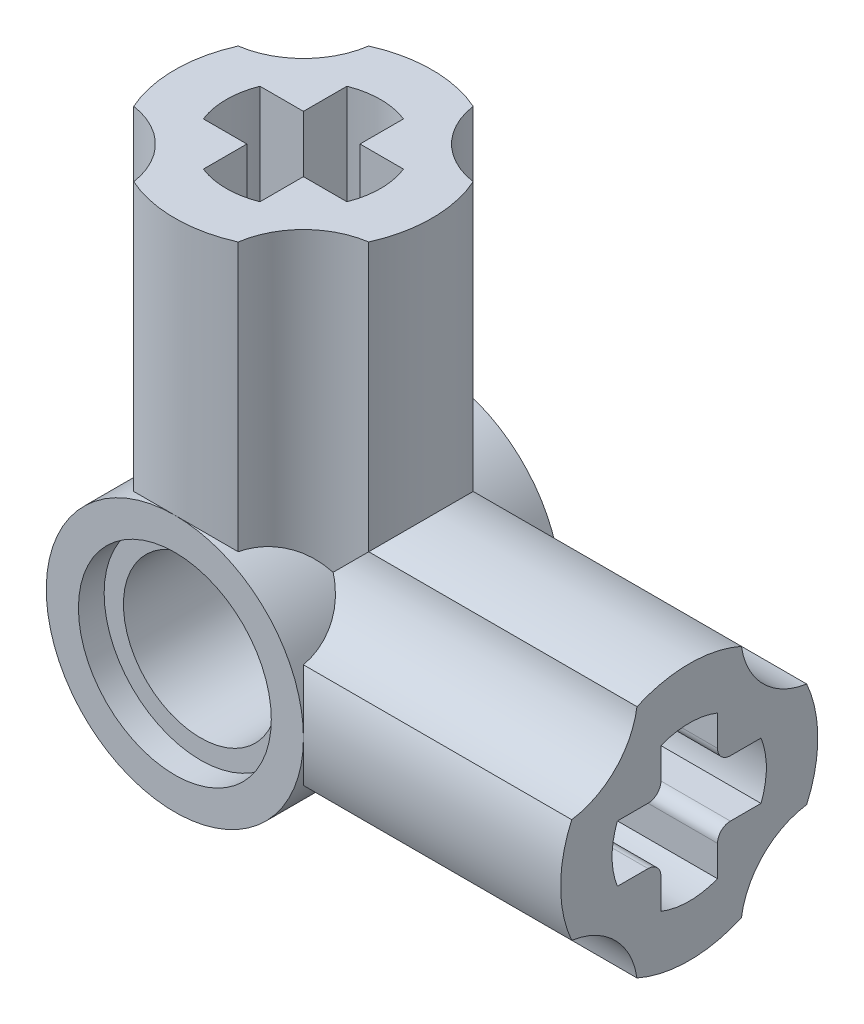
ISO-10303-21;
HEADER;
FILE_DESCRIPTION(('STEP AP214'),'2;1');
FILE_NAME('part.step','',(''),(''),'','','');
FILE_SCHEMA(('AUTOMOTIVE_DESIGN { 1 0 10303 214 1 1 1 1 }'));
ENDSEC;
DATA;
#1=APPLICATION_CONTEXT('core data for automotive mechanical design processes');
#2=APPLICATION_PROTOCOL_DEFINITION('international standard','automotive_design',2000,#1);
#3=PRODUCT_CONTEXT('',#1,'mechanical');
#4=PRODUCT('Part','Part','',(#3));
#5=PRODUCT_RELATED_PRODUCT_CATEGORY('part','',(#4));
#6=PRODUCT_DEFINITION_FORMATION('','',#4);
#7=PRODUCT_DEFINITION_CONTEXT('part definition',#1,'design');
#8=PRODUCT_DEFINITION('design','',#6,#7);
#9=PRODUCT_DEFINITION_SHAPE('','',#8);
#10=(LENGTH_UNIT() NAMED_UNIT(*) SI_UNIT(.MILLI.,.METRE.));
#11=(NAMED_UNIT(*) PLANE_ANGLE_UNIT() SI_UNIT($,.RADIAN.));
#12=(NAMED_UNIT(*) SI_UNIT($,.STERADIAN.) SOLID_ANGLE_UNIT());
#13=UNCERTAINTY_MEASURE_WITH_UNIT(LENGTH_MEASURE(1.E-05),#10,'distance_accuracy_value','');
#14=(GEOMETRIC_REPRESENTATION_CONTEXT(3) GLOBAL_UNCERTAINTY_ASSIGNED_CONTEXT((#13)) GLOBAL_UNIT_ASSIGNED_CONTEXT((#10,
#11,#12)) REPRESENTATION_CONTEXT('',''));
#15=CARTESIAN_POINT('',(0.,0.,0.));
#16=DIRECTION('',(0.,0.,1.));
#17=DIRECTION('',(1.,0.,0.));
#18=AXIS2_PLACEMENT_3D('',#15,#16,#17);
#19=CARTESIAN_POINT('',(-12.,0.,-4.));
#20=DIRECTION('',(0.,0.,1.));
#21=DIRECTION('',(1.,0.,0.));
#22=AXIS2_PLACEMENT_3D('',#19,#20,#21);
#23=CYLINDRICAL_SURFACE('',#22,4.);
#24=CARTESIAN_POINT('',(-10.375086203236,3.65508620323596,-3.65508620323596));
#25=CARTESIAN_POINT('',(-10.3663499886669,3.6511923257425,-3.59486576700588));
#26=CARTESIAN_POINT('',(-10.3553154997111,3.64625909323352,-3.53504696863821));
#27=CARTESIAN_POINT('',(-10.3288074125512,3.63419138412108,-3.41662458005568));
#28=CARTESIAN_POINT('',(-10.3133336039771,3.6270568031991,-3.35802104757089));
#29=CARTESIAN_POINT('',(-10.2781165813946,3.61046958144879,-3.24248433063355));
#30=CARTESIAN_POINT('',(-10.2583761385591,3.60101844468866,-3.18555008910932));
#31=CARTESIAN_POINT('',(-10.2148697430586,3.57965042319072,-3.07373991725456));
#32=CARTESIAN_POINT('',(-10.1911039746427,3.5677336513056,-3.0188638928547));
#33=CARTESIAN_POINT('',(-10.114107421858,3.52799627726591,-2.85777764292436));
#34=CARTESIAN_POINT('',(-10.0551913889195,3.49619476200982,-2.75515449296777));
#35=CARTESIAN_POINT('',(-9.9255116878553,3.42083149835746,-2.56268164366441));
#36=CARTESIAN_POINT('',(-9.85475604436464,3.37727770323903,-2.47282336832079));
#37=CARTESIAN_POINT('',(-9.7062336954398,3.27818541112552,-2.30858168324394));
#38=CARTESIAN_POINT('',(-9.62854800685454,3.22277694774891,-2.2340463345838));
#39=CARTESIAN_POINT('',(-9.46997240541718,3.09984101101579,-2.10000614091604));
#40=CARTESIAN_POINT('',(-9.38908270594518,3.03231434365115,-2.0405002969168));
#41=CARTESIAN_POINT('',(-9.22442455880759,2.88255864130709,-1.93338471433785));
#42=CARTESIAN_POINT('',(-9.14070232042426,2.79978283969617,-1.88647591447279));
#43=CARTESIAN_POINT('',(-8.97797282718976,2.62331757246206,-1.80641185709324));
#44=CARTESIAN_POINT('',(-8.89897728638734,2.52960256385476,-1.77328964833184));
#45=CARTESIAN_POINT('',(-8.77678381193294,2.36999962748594,-1.72863096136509));
#46=CARTESIAN_POINT('',(-8.73124104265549,2.30680175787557,-1.71365358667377));
#47=CARTESIAN_POINT('',(-8.64357970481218,2.17728118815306,-1.68744785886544));
#48=CARTESIAN_POINT('',(-8.60146262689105,2.11095714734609,-1.67622113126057));
#49=CARTESIAN_POINT('',(-8.52124740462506,1.97595890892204,-1.65692530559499));
#50=CARTESIAN_POINT('',(-8.48312990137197,1.90729838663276,-1.64884043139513));
#51=CARTESIAN_POINT('',(-8.41094214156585,1.76772376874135,-1.63516177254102));
#52=CARTESIAN_POINT('',(-8.37686797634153,1.69681193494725,-1.62956556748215));
#53=CARTESIAN_POINT('',(-8.34491379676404,1.62491379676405,-1.62491379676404));
#54=B_SPLINE_CURVE_WITH_KNOTS('',3,(#24,#25,#26,#27,#28,#29,#30,#31,#32,#33,#34,#35,#36,#37,#38,
#39,#40,#41,#42,#43,#44,#45,#46,#47,#48,#49,#50,#51,#52,#53),.UNSPECIFIED.,.F.,.F.,(4,2,2,2,2,2,
2,2,2,2,2,2,2,2,4),(0.,0.182870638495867,0.365749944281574,0.548510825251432,0.731263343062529,
1.09690984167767,1.4623095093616,1.82388969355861,2.18544583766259,2.56420913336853,
2.9438752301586,3.18164590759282,3.41951950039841,3.65618273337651,3.89261528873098),.UNSPECIFIED.);
#55=CARTESIAN_POINT('',(-10.3750862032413,3.65508620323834,-3.65508620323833));
#56=VERTEX_POINT('',#55);
#57=CARTESIAN_POINT('',(-9.17157287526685,2.82842712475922,-1.90538380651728));
#58=VERTEX_POINT('',#57);
#59=EDGE_CURVE('P0_E1296',#56,#58,#54,.T.);
#60=ORIENTED_EDGE('',*,*,#59,.T.);
#61=CARTESIAN_POINT('',(-10.3750862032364,3.65508620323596,-1.62491379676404));
#62=CARTESIAN_POINT('',(-10.2823139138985,3.61387188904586,-1.63092923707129));
#63=CARTESIAN_POINT('',(-10.1911709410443,3.56909577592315,-1.6384992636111));
#64=CARTESIAN_POINT('',(-10.0126857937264,3.47287100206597,-1.65807936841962));
#65=CARTESIAN_POINT('',(-9.92535378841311,3.42140579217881,-1.67010060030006));
#66=CARTESIAN_POINT('',(-9.75492013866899,3.31209012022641,-1.7000001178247));
#67=CARTESIAN_POINT('',(-9.67185200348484,3.25419788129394,-1.7179184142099));
#68=CARTESIAN_POINT('',(-9.51161777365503,3.13337103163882,-1.76101246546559));
#69=CARTESIAN_POINT('',(-9.43444436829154,3.07044287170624,-1.78617903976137));
#70=CARTESIAN_POINT('',(-9.26343126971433,2.92025141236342,-1.85455544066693));
#71=CARTESIAN_POINT('',(-9.17204364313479,2.83158792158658,-1.90095472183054));
#72=CARTESIAN_POINT('',(-9.00335038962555,2.65238561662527,-2.01130610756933));
#73=CARTESIAN_POINT('',(-8.92598770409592,2.56185614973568,-2.07518430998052));
#74=CARTESIAN_POINT('',(-8.82101407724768,2.42844107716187,-2.1851770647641));
#75=CARTESIAN_POINT('',(-8.78775386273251,2.38418821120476,-2.22439555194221));
#76=CARTESIAN_POINT('',(-8.72509637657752,2.29735939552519,-2.30748194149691));
#77=CARTESIAN_POINT('',(-8.6956974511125,2.25478273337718,-2.35134783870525));
#78=CARTESIAN_POINT('',(-8.64070585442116,2.17200832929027,-2.44362830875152));
#79=CARTESIAN_POINT('',(-8.61511868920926,2.13181407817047,-2.49204929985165));
#80=CARTESIAN_POINT('',(-8.5677048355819,2.05460502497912,-2.59305777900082));
#81=CARTESIAN_POINT('',(-8.54587776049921,2.01758989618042,-2.64564483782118));
#82=CARTESIAN_POINT('',(-8.48962965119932,1.91902233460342,-2.79865941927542));
#83=CARTESIAN_POINT('',(-8.45926306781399,1.86177889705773,-2.90344215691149));
#84=CARTESIAN_POINT('',(-8.40905565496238,1.763013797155,-3.12233368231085));
#85=CARTESIAN_POINT('',(-8.38920111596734,1.72147167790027,-3.23643009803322));
#86=CARTESIAN_POINT('',(-8.3675178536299,1.67490117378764,-3.40287021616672));
#87=CARTESIAN_POINT('',(-8.36190160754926,1.6626424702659,-3.45281321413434));
#88=CARTESIAN_POINT('',(-8.35224853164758,1.64135387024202,-3.55343145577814));
#89=CARTESIAN_POINT('',(-8.34820866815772,1.6323177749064,-3.6041050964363));
#90=CARTESIAN_POINT('',(-8.34491379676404,1.62491379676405,-3.6550862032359));
#91=B_SPLINE_CURVE_WITH_KNOTS('',3,(#61,#62,#63,#64,#65,#66,#67,#68,#69,#70,#71,#72,#73,#74,#75,
#76,#77,#78,#79,#80,#81,#82,#83,#84,#85,#86,#87,#88,#89,#90),.UNSPECIFIED.,.F.,.F.,(4,2,2,2,2,2,
2,2,2,2,2,2,2,2,4),(0.,0.305068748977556,0.61090715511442,0.918864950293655,1.22643439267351,
1.63131432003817,2.0345081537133,2.23779057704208,2.44098564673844,2.64447143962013,
2.84793629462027,3.21562348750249,3.58282996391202,3.73791688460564,3.89270385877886),.UNSPECIFIED.);
#92=CARTESIAN_POINT('',(-8.34491379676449,1.62491379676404,-3.65508620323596));
#93=VERTEX_POINT('',#92);
#94=EDGE_CURVE('P0_E806',#58,#93,#91,.T.);
#95=ORIENTED_EDGE('',*,*,#94,.T.);
#96=CARTESIAN_POINT('',(-12.0000000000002,0.,0.));
#97=DIRECTION('',(0.707106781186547,0.,0.707106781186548));
#98=DIRECTION('',(0.707106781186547,0.,-0.707106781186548));
#99=AXIS2_PLACEMENT_3D('',#96,#97,#98);
#100=ELLIPSE('',#99,5.65685424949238,4.);
#101=CARTESIAN_POINT('',(-8.,0.,-4.));
#102=VERTEX_POINT('',#101);
#103=EDGE_CURVE('P0_E830',#93,#102,#100,.F.);
#104=ORIENTED_EDGE('',*,*,#103,.T.);
#105=CARTESIAN_POINT('',(-12.,0.,-4.));
#106=DIRECTION('',(0.,0.,1.));
#107=DIRECTION('',(1.,0.,0.));
#108=AXIS2_PLACEMENT_3D('',#105,#106,#107);
#109=CIRCLE('',#108,4.);
#110=CARTESIAN_POINT('',(-12.,4.,-4.));
#111=VERTEX_POINT('',#110);
#112=EDGE_CURVE('P0_E860',#102,#111,#109,.T.);
#113=ORIENTED_EDGE('',*,*,#112,.T.);
#114=CARTESIAN_POINT('',(-12.,0.,0.));
#115=DIRECTION('',(0.,0.707106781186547,0.707106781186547));
#116=DIRECTION('',(0.,0.707106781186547,-0.707106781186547));
#117=AXIS2_PLACEMENT_3D('',#114,#115,#116);
#118=ELLIPSE('',#117,5.65685424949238,4.);
#119=EDGE_CURVE('P0_E69',#111,#56,#118,.F.);
#120=ORIENTED_EDGE('',*,*,#119,.T.);
#121=EDGE_LOOP('',(#60,#95,#104,#113,#120));
#122=FACE_BOUND('',#121,.T.);
#123=ADVANCED_FACE('P0_F41',(#122),#23,.T.);
#124=CARTESIAN_POINT('',(-13.6249137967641,3.65508620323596,-3.65508620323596));
#125=VERTEX_POINT('',#124);
#126=EDGE_CURVE('P0_E624',#125,#111,#118,.F.);
#127=ORIENTED_EDGE('',*,*,#126,.T.);
#128=EDGE_CURVE('P0_E859',#111,#102,#109,.T.);
#129=ORIENTED_EDGE('',*,*,#128,.T.);
#130=CARTESIAN_POINT('',(-8.34491379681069,-1.62491379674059,-3.65508620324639));
#131=VERTEX_POINT('',#130);
#132=EDGE_CURVE('P0_E853',#102,#131,#100,.F.);
#133=ORIENTED_EDGE('',*,*,#132,.T.);
#134=CARTESIAN_POINT('',(-8.3449137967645,-1.62491379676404,-3.65508620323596));
#135=CARTESIAN_POINT('',(-8.34880767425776,-1.63365001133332,-3.59486576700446));
#136=CARTESIAN_POINT('',(-8.35374090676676,-1.64468450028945,-3.5350469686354));
#137=CARTESIAN_POINT('',(-8.3658086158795,-1.67119258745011,-3.41662458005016));
#138=CARTESIAN_POINT('',(-8.37294319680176,-1.68666639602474,-3.35802104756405));
#139=CARTESIAN_POINT('',(-8.38953041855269,-1.72188341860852,-3.2424843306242));
#140=CARTESIAN_POINT('',(-8.39898155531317,-1.74162386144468,-3.18555008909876));
#141=CARTESIAN_POINT('',(-8.42034957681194,-1.78513025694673,-3.07373991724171));
#142=CARTESIAN_POINT('',(-8.43226634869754,-1.80889602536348,-3.01886389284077));
#143=CARTESIAN_POINT('',(-8.47200372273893,-1.88589257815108,-2.85777764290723));
#144=CARTESIAN_POINT('',(-8.50380523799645,-1.94480861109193,-2.75515449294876));
#145=CARTESIAN_POINT('',(-8.57916850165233,-2.07448831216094,-2.56268164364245));
#146=CARTESIAN_POINT('',(-8.62272229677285,-2.1452439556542,-2.47282336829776));
#147=CARTESIAN_POINT('',(-8.72181458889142,-2.29376630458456,-2.3085816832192));
#148=CARTESIAN_POINT('',(-8.77722305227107,-2.37145199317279,-2.23404633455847));
#149=CARTESIAN_POINT('',(-8.90015898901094,-2.53002759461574,-2.10000614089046));
#150=CARTESIAN_POINT('',(-8.96768565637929,-2.61091729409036,-2.04050029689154));
#151=CARTESIAN_POINT('',(-9.11744135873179,-2.77557544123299,-1.93338471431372));
#152=CARTESIAN_POINT('',(-9.2002171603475,-2.85929767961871,-1.88647591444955));
#153=CARTESIAN_POINT('',(-9.37668242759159,-3.02202717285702,-1.80641185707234));
#154=CARTESIAN_POINT('',(-9.4703974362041,-3.10102271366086,-1.77328964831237));
#155=CARTESIAN_POINT('',(-9.63000037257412,-3.22321618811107,-1.72863096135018));
#156=CARTESIAN_POINT('',(-9.69319824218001,-3.26875895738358,-1.71365358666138));
#157=CARTESIAN_POINT('',(-9.82271881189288,-3.35642029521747,-1.6874478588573));
#158=CARTESIAN_POINT('',(-9.88904285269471,-3.39853737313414,-1.67622113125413));
#159=CARTESIAN_POINT('',(-10.024041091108,-3.47875259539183,-1.65692530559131));
#160=CARTESIAN_POINT('',(-10.0927016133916,-3.51687009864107,-1.6488404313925));
#161=CARTESIAN_POINT('',(-10.2322762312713,-3.58905785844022,-1.63516177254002));
#162=CARTESIAN_POINT('',(-10.3031880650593,-3.62313202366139,-1.62956556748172));
#163=CARTESIAN_POINT('',(-10.3750862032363,-3.65508620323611,-1.62491379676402));
#164=B_SPLINE_CURVE_WITH_KNOTS('',3,(#134,#135,#136,#137,#138,#139,#140,#141,#142,#143,#144,
#145,#146,#147,#148,#149,#150,#151,#152,#153,#154,#155,#156,#157,#158,#159,#160,#161,#162,#163),
.UNSPECIFIED.,.F.,.F.,(4,2,2,2,2,2,2,2,2,2,2,2,2,2,4),(0.,0.182870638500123,0.365749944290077,
0.548510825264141,0.731263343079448,1.09690984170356,1.46230950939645,1.82388969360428,
2.18544583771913,2.56420913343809,2.94387523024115,3.18164590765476,3.41951950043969,
3.65618273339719,3.89261528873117),.UNSPECIFIED.);
#165=CARTESIAN_POINT('',(-10.3750862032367,-3.65508620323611,-1.62491379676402));
#166=VERTEX_POINT('',#165);
#167=EDGE_CURVE('P0_E847',#131,#166,#164,.T.);
#168=ORIENTED_EDGE('',*,*,#167,.T.);
#169=CARTESIAN_POINT('',(-12.0000000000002,0.,0.));
#170=DIRECTION('',(0.707106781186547,0.,0.707106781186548));
#171=DIRECTION('',(0.707106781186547,0.,-0.707106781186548));
#172=AXIS2_PLACEMENT_3D('',#169,#170,#171);
#173=ELLIPSE('',#172,5.65685424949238,4.);
#174=CARTESIAN_POINT('',(-12.0000000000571,-4.,0.));
#175=VERTEX_POINT('',#174);
#176=EDGE_CURVE('P0_E855',#166,#175,#173,.F.);
#177=ORIENTED_EDGE('',*,*,#176,.T.);
#178=CARTESIAN_POINT('',(-12.0000000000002,0.,0.));
#179=DIRECTION('',(0.707106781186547,0.,-0.707106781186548));
#180=DIRECTION('',(0.707106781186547,0.,0.707106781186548));
#181=AXIS2_PLACEMENT_3D('',#178,#179,#180);
#182=ELLIPSE('',#181,5.65685424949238,4.);
#183=CARTESIAN_POINT('',(-10.3750862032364,-3.65508620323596,1.62491379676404));
#184=VERTEX_POINT('',#183);
#185=EDGE_CURVE('P0_E854',#175,#184,#182,.F.);
#186=ORIENTED_EDGE('',*,*,#185,.T.);
#187=CARTESIAN_POINT('',(-10.3750862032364,-3.65508620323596,1.62491379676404));
#188=CARTESIAN_POINT('',(-10.2823139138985,-3.61387188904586,1.63092923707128));
#189=CARTESIAN_POINT('',(-10.1911709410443,-3.56909577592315,1.6384992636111));
#190=CARTESIAN_POINT('',(-10.0126857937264,-3.47287100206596,1.65807936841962));
#191=CARTESIAN_POINT('',(-9.9253537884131,-3.42140579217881,1.67010060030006));
#192=CARTESIAN_POINT('',(-9.75492013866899,-3.3120901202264,1.7000001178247));
#193=CARTESIAN_POINT('',(-9.67185200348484,-3.25419788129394,1.71791841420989));
#194=CARTESIAN_POINT('',(-9.51161777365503,-3.13337103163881,1.76101246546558));
#195=CARTESIAN_POINT('',(-9.43444436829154,-3.07044287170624,1.78617903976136));
#196=CARTESIAN_POINT('',(-9.26343126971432,-2.92025141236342,1.85455544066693));
#197=CARTESIAN_POINT('',(-9.17204364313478,-2.83158792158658,1.90095472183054));
#198=CARTESIAN_POINT('',(-9.00335038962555,-2.65238561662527,2.01130610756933));
#199=CARTESIAN_POINT('',(-8.92598770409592,-2.56185614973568,2.07518430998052));
#200=CARTESIAN_POINT('',(-8.82101407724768,-2.42844107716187,2.1851770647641));
#201=CARTESIAN_POINT('',(-8.7877538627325,-2.38418821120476,2.22439555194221));
#202=CARTESIAN_POINT('',(-8.72509637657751,-2.29735939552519,2.30748194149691));
#203=CARTESIAN_POINT('',(-8.69569745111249,-2.25478273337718,2.35134783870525));
#204=CARTESIAN_POINT('',(-8.64070585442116,-2.17200832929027,2.44362830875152));
#205=CARTESIAN_POINT('',(-8.61511868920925,-2.13181407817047,2.49204929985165));
#206=CARTESIAN_POINT('',(-8.5677048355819,-2.05460502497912,2.59305777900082));
#207=CARTESIAN_POINT('',(-8.54587776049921,-2.01758989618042,2.64564483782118));
#208=CARTESIAN_POINT('',(-8.48962965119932,-1.91902233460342,2.79865941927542));
#209=CARTESIAN_POINT('',(-8.45926306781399,-1.86177889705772,2.90344215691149));
#210=CARTESIAN_POINT('',(-8.40905565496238,-1.763013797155,3.12233368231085));
#211=CARTESIAN_POINT('',(-8.38920111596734,-1.72147167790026,3.23643009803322));
#212=CARTESIAN_POINT('',(-8.3675178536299,-1.67490117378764,3.40287021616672));
#213=CARTESIAN_POINT('',(-8.36190160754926,-1.66264247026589,3.45281321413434));
#214=CARTESIAN_POINT('',(-8.35224853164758,-1.64135387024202,3.55343145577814));
#215=CARTESIAN_POINT('',(-8.34820866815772,-1.6323177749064,3.6041050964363));
#216=CARTESIAN_POINT('',(-8.34491379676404,-1.62491379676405,3.65508620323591));
#217=B_SPLINE_CURVE_WITH_KNOTS('',3,(#187,#188,#189,#190,#191,#192,#193,#194,#195,#196,#197,
#198,#199,#200,#201,#202,#203,#204,#205,#206,#207,#208,#209,#210,#211,#212,#213,#214,#215,#216),
.UNSPECIFIED.,.F.,.F.,(4,2,2,2,2,2,2,2,2,2,2,2,2,2,4),(0.,0.305068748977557,0.610907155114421,
0.918864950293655,1.22643439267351,1.63131432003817,2.03450815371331,2.23779057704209,
2.44098564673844,2.64447143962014,2.84793629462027,3.21562348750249,3.58282996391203,
3.73791688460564,3.89270385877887),.UNSPECIFIED.);
#218=CARTESIAN_POINT('',(-8.34491379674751,-1.62491379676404,3.65508620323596));
#219=VERTEX_POINT('',#218);
#220=EDGE_CURVE('P0_E794',#184,#219,#217,.T.);
#221=ORIENTED_EDGE('',*,*,#220,.T.);
#222=CARTESIAN_POINT('',(-12.0000000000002,0.,0.));
#223=DIRECTION('',(0.707106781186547,0.,-0.707106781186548));
#224=DIRECTION('',(0.707106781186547,0.,0.707106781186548));
#225=AXIS2_PLACEMENT_3D('',#222,#223,#224);
#226=ELLIPSE('',#225,5.65685424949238,4.);
#227=CARTESIAN_POINT('',(-8.,0.,4.));
#228=VERTEX_POINT('',#227);
#229=EDGE_CURVE('P0_E795',#219,#228,#226,.F.);
#230=ORIENTED_EDGE('',*,*,#229,.T.);
#231=CARTESIAN_POINT('',(-12.,0.,4.));
#232=DIRECTION('',(0.,0.,1.));
#233=DIRECTION('',(1.,0.,0.));
#234=AXIS2_PLACEMENT_3D('',#231,#232,#233);
#235=CIRCLE('',#234,4.);
#236=CARTESIAN_POINT('',(-12.,4.,4.));
#237=VERTEX_POINT('',#236);
#238=EDGE_CURVE('P0_E798',#237,#228,#235,.T.);
#239=ORIENTED_EDGE('',*,*,#238,.F.);
#240=CARTESIAN_POINT('',(-12.,0.,0.));
#241=DIRECTION('',(0.,0.707106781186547,-0.707106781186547));
#242=DIRECTION('',(0.,0.707106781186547,0.707106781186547));
#243=AXIS2_PLACEMENT_3D('',#240,#241,#242);
#244=ELLIPSE('',#243,5.65685424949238,4.);
#245=CARTESIAN_POINT('',(-13.6249137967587,3.65508620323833,3.65508620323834));
#246=VERTEX_POINT('',#245);
#247=EDGE_CURVE('P0_E383',#237,#246,#244,.F.);
#248=ORIENTED_EDGE('',*,*,#247,.T.);
#249=CARTESIAN_POINT('',(-13.624913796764,3.65508620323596,3.65508620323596));
#250=CARTESIAN_POINT('',(-13.6336500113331,3.65119232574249,3.59486576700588));
#251=CARTESIAN_POINT('',(-13.6446845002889,3.64625909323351,3.53504696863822));
#252=CARTESIAN_POINT('',(-13.6711925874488,3.63419138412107,3.41662458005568));
#253=CARTESIAN_POINT('',(-13.6866663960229,3.62705680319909,3.35802104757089));
#254=CARTESIAN_POINT('',(-13.7218834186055,3.61046958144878,3.24248433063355));
#255=CARTESIAN_POINT('',(-13.7416238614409,3.60101844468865,3.18555008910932));
#256=CARTESIAN_POINT('',(-13.7851302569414,3.57965042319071,3.07373991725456));
#257=CARTESIAN_POINT('',(-13.8088960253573,3.56773365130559,3.0188638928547));
#258=CARTESIAN_POINT('',(-13.885892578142,3.5279962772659,2.85777764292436));
#259=CARTESIAN_POINT('',(-13.9448086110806,3.49619476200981,2.75515449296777));
#260=CARTESIAN_POINT('',(-14.0744883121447,3.42083149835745,2.56268164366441));
#261=CARTESIAN_POINT('',(-14.1452439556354,3.37727770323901,2.47282336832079));
#262=CARTESIAN_POINT('',(-14.2937663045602,3.2781854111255,2.30858168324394));
#263=CARTESIAN_POINT('',(-14.3714519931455,3.22277694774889,2.2340463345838));
#264=CARTESIAN_POINT('',(-14.5300275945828,3.09984101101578,2.10000614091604));
#265=CARTESIAN_POINT('',(-14.6109172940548,3.03231434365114,2.0405002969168));
#266=CARTESIAN_POINT('',(-14.7755754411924,2.88255864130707,1.93338471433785));
#267=CARTESIAN_POINT('',(-14.8592976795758,2.79978283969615,1.88647591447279));
#268=CARTESIAN_POINT('',(-15.0220271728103,2.62331757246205,1.80641185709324));
#269=CARTESIAN_POINT('',(-15.1010227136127,2.52960256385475,1.77328964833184));
#270=CARTESIAN_POINT('',(-15.2232161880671,2.36999962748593,1.72863096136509));
#271=CARTESIAN_POINT('',(-15.2687589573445,2.30680175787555,1.71365358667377));
#272=CARTESIAN_POINT('',(-15.3564202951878,2.17728118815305,1.68744785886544));
#273=CARTESIAN_POINT('',(-15.398537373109,2.11095714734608,1.67622113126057));
#274=CARTESIAN_POINT('',(-15.4787525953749,1.97595890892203,1.65692530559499));
#275=CARTESIAN_POINT('',(-15.516870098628,1.90729838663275,1.64884043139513));
#276=CARTESIAN_POINT('',(-15.5890578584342,1.76772376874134,1.63516177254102));
#277=CARTESIAN_POINT('',(-15.6231320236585,1.69681193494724,1.62956556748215));
#278=CARTESIAN_POINT('',(-15.655086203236,1.62491379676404,1.62491379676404));
#279=B_SPLINE_CURVE_WITH_KNOTS('',3,(#249,#250,#251,#252,#253,#254,#255,#256,#257,#258,#259,
#260,#261,#262,#263,#264,#265,#266,#267,#268,#269,#270,#271,#272,#273,#274,#275,#276,#277,#278),
.UNSPECIFIED.,.F.,.F.,(4,2,2,2,2,2,2,2,2,2,2,2,2,2,4),(0.,0.182870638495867,0.365749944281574,
0.548510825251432,0.731263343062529,1.09690984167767,1.4623095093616,1.82388969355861,
2.18544583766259,2.56420913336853,2.9438752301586,3.18164590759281,3.4195195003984,
3.6561827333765,3.89261528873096),.UNSPECIFIED.);
#280=CARTESIAN_POINT('',(-15.655086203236,1.62491379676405,1.62491379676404));
#281=VERTEX_POINT('',#280);
#282=EDGE_CURVE('P0_E566',#246,#281,#279,.T.);
#283=ORIENTED_EDGE('',*,*,#282,.T.);
#284=CARTESIAN_POINT('',(-12.,0.,0.));
#285=DIRECTION('',(0.,0.707106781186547,-0.707106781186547));
#286=DIRECTION('',(0.,0.707106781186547,0.707106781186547));
#287=AXIS2_PLACEMENT_3D('',#284,#285,#286);
#288=ELLIPSE('',#287,5.65685424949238,4.);
#289=CARTESIAN_POINT('',(-16.,0.,0.));
#290=VERTEX_POINT('',#289);
#291=EDGE_CURVE('P0_E1244',#281,#290,#288,.F.);
#292=ORIENTED_EDGE('',*,*,#291,.T.);
#293=CARTESIAN_POINT('',(-12.,0.,0.));
#294=DIRECTION('',(0.,0.707106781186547,0.707106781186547));
#295=DIRECTION('',(0.,0.707106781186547,-0.707106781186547));
#296=AXIS2_PLACEMENT_3D('',#293,#294,#295);
#297=ELLIPSE('',#296,5.65685424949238,4.);
#298=CARTESIAN_POINT('',(-15.6550862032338,1.62491379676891,-1.62491379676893));
#299=VERTEX_POINT('',#298);
#300=EDGE_CURVE('P0_E623',#290,#299,#297,.F.);
#301=ORIENTED_EDGE('',*,*,#300,.T.);
#302=CARTESIAN_POINT('',(-15.655086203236,1.62491379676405,-1.62491379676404));
#303=CARTESIAN_POINT('',(-15.6138718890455,1.71768608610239,-1.63092923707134));
#304=CARTESIAN_POINT('',(-15.5690957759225,1.80882905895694,-1.63849926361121));
#305=CARTESIAN_POINT('',(-15.4728710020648,1.9873142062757,-1.65807936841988));
#306=CARTESIAN_POINT('',(-15.4214057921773,2.0746462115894,-1.67010060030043));
#307=CARTESIAN_POINT('',(-15.3120901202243,2.2450798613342,-1.70000011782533));
#308=CARTESIAN_POINT('',(-15.2541978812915,2.32814799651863,-1.7179184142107));
#309=CARTESIAN_POINT('',(-15.1333710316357,2.48838222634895,-1.7610124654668));
#310=CARTESIAN_POINT('',(-15.0704428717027,2.56555563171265,-1.78617903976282));
#311=CARTESIAN_POINT('',(-14.9202514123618,2.73656873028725,-1.85455544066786));
#312=CARTESIAN_POINT('',(-14.8315879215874,2.82795635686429,-1.90095472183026));
#313=CARTESIAN_POINT('',(-14.6523856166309,2.99664961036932,-2.01130610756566));
#314=CARTESIAN_POINT('',(-14.5618561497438,3.07401229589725,-2.07518430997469));
#315=CARTESIAN_POINT('',(-14.4284410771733,3.17898592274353,-2.18517706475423));
#316=CARTESIAN_POINT('',(-14.3841882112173,3.21224613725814,-2.22439555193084));
#317=CARTESIAN_POINT('',(-14.2973593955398,3.27490362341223,-2.3074819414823));
#318=CARTESIAN_POINT('',(-14.2547827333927,3.3043025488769,-2.35134783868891));
#319=CARTESIAN_POINT('',(-14.1720083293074,3.35929414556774,-2.44362830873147));
#320=CARTESIAN_POINT('',(-14.1318140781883,3.3848813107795,-2.49204929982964));
#321=CARTESIAN_POINT('',(-14.0546050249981,3.43229516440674,-2.59305777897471));
#322=CARTESIAN_POINT('',(-14.0175898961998,3.45412223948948,-2.64564483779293));
#323=CARTESIAN_POINT('',(-13.9190223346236,3.51037034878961,-2.79865941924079));
#324=CARTESIAN_POINT('',(-13.861778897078,3.54073693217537,-2.90344215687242));
#325=CARTESIAN_POINT('',(-13.7630137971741,3.59094434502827,-3.1223336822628));
#326=CARTESIAN_POINT('',(-13.7214716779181,3.61079888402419,-3.23643009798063));
#327=CARTESIAN_POINT('',(-13.6749011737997,3.63248214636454,-3.40287021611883));
#328=CARTESIAN_POINT('',(-13.6626424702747,3.63809839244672,-3.45281321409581));
#329=CARTESIAN_POINT('',(-13.6413538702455,3.64775146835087,-3.55343145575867));
#330=CARTESIAN_POINT('',(-13.6323177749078,3.65179133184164,-3.60410509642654));
#331=CARTESIAN_POINT('',(-13.6249137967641,3.65508620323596,-3.65508620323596));
#332=B_SPLINE_CURVE_WITH_KNOTS('',3,(#302,#303,#304,#305,#306,#307,#308,#309,#310,#311,#312,
#313,#314,#315,#316,#317,#318,#319,#320,#321,#322,#323,#324,#325,#326,#327,#328,#329,#330,#331),
.UNSPECIFIED.,.F.,.F.,(4,2,2,2,2,2,2,2,2,2,2,2,2,2,4),(0.,0.305068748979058,0.610907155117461,
0.918864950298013,1.22643439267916,1.63131432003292,2.03450815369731,2.23779057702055,
2.44098564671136,2.64447143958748,2.84793629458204,3.21562348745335,3.58282996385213,
3.7379168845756,3.89270385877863),.UNSPECIFIED.);
#333=EDGE_CURVE('P0_E616',#299,#125,#332,.T.);
#334=ORIENTED_EDGE('',*,*,#333,.T.);
#335=EDGE_LOOP('',(#127,#129,#133,#168,#177,#186,#221,#230,#239,#248,#283,#292,#301,#334));
#336=FACE_BOUND('',#335,.T.);
#337=ADVANCED_FACE('P0_F526',(#336),#23,.T.);
#338=CARTESIAN_POINT('',(-8.34491379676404,1.62491379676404,1.62491379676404));
#339=CARTESIAN_POINT('',(-8.38612811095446,1.71768608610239,1.63092923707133));
#340=CARTESIAN_POINT('',(-8.43090422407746,1.80882905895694,1.6384992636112));
#341=CARTESIAN_POINT('',(-8.52712899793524,1.9873142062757,1.65807936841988));
#342=CARTESIAN_POINT('',(-8.5785942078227,2.0746462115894,1.67010060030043));
#343=CARTESIAN_POINT('',(-8.68790987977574,2.2450798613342,1.70000011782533));
#344=CARTESIAN_POINT('',(-8.74580211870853,2.32814799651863,1.71791841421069));
#345=CARTESIAN_POINT('',(-8.86662896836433,2.48838222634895,1.76101246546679));
#346=CARTESIAN_POINT('',(-8.92955712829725,2.56555563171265,1.78617903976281));
#347=CARTESIAN_POINT('',(-9.07974858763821,2.73656873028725,1.85455544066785));
#348=CARTESIAN_POINT('',(-9.16841207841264,2.82795635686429,1.90095472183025));
#349=CARTESIAN_POINT('',(-9.34761438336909,2.99664961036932,2.01130610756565));
#350=CARTESIAN_POINT('',(-9.43814385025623,3.07401229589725,2.07518430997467));
#351=CARTESIAN_POINT('',(-9.57155892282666,3.17898592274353,2.18517706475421));
#352=CARTESIAN_POINT('',(-9.61581178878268,3.21224613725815,2.22439555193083));
#353=CARTESIAN_POINT('',(-9.70264060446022,3.27490362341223,2.30748194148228));
#354=CARTESIAN_POINT('',(-9.74521726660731,3.30430254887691,2.35134783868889));
#355=CARTESIAN_POINT('',(-9.8279916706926,3.35929414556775,2.44362830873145));
#356=CARTESIAN_POINT('',(-9.8681859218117,3.38488131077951,2.49204929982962));
#357=CARTESIAN_POINT('',(-9.94539497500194,3.43229516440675,2.59305777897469));
#358=CARTESIAN_POINT('',(-9.98241010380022,3.45412223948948,2.64564483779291));
#359=CARTESIAN_POINT('',(-10.0809776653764,3.51037034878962,2.79865941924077));
#360=CARTESIAN_POINT('',(-10.138221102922,3.54073693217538,2.9034421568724));
#361=CARTESIAN_POINT('',(-10.236986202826,3.59094434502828,3.12233368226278));
#362=CARTESIAN_POINT('',(-10.2785283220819,3.61079888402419,3.23643009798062));
#363=CARTESIAN_POINT('',(-10.3250988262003,3.63248214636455,3.40287021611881));
#364=CARTESIAN_POINT('',(-10.3373575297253,3.63809839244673,3.45281321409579));
#365=CARTESIAN_POINT('',(-10.3586461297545,3.64775146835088,3.55343145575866));
#366=CARTESIAN_POINT('',(-10.3676822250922,3.65179133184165,3.60410509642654));
#367=CARTESIAN_POINT('',(-10.375086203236,3.65508620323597,3.65508620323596));
#368=B_SPLINE_CURVE_WITH_KNOTS('',3,(#338,#339,#340,#341,#342,#343,#344,#345,#346,#347,#348,
#349,#350,#351,#352,#353,#354,#355,#356,#357,#358,#359,#360,#361,#362,#363,#364,#365,#366,#367),
.UNSPECIFIED.,.F.,.F.,(4,2,2,2,2,2,2,2,2,2,2,2,2,2,4),(0.,0.305068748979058,0.610907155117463,
0.918864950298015,1.22643439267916,1.63131432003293,2.03450815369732,2.23779057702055,
2.44098564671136,2.64447143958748,2.84793629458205,3.21562348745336,3.58282996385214,
3.73791688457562,3.89270385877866),.UNSPECIFIED.);
#369=CARTESIAN_POINT('',(-9.17157287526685,2.82842712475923,1.90538380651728));
#370=VERTEX_POINT('',#369);
#371=CARTESIAN_POINT('',(-10.3750862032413,3.65508620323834,3.65508620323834));
#372=VERTEX_POINT('',#371);
#373=EDGE_CURVE('P0_E546',#370,#372,#368,.T.);
#374=ORIENTED_EDGE('',*,*,#373,.T.);
#375=EDGE_CURVE('P0_E549',#372,#237,#244,.F.);
#376=ORIENTED_EDGE('',*,*,#375,.T.);
#377=EDGE_CURVE('P0_E856',#228,#237,#235,.T.);
#378=ORIENTED_EDGE('',*,*,#377,.F.);
#379=CARTESIAN_POINT('',(-8.34491379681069,1.62491379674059,3.65508620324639));
#380=VERTEX_POINT('',#379);
#381=EDGE_CURVE('P0_E799',#228,#380,#226,.F.);
#382=ORIENTED_EDGE('',*,*,#381,.T.);
#383=CARTESIAN_POINT('',(-8.34491379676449,1.62491379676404,3.65508620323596));
#384=CARTESIAN_POINT('',(-8.34880767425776,1.63365001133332,3.59486576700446));
#385=CARTESIAN_POINT('',(-8.35374090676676,1.64468450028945,3.5350469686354));
#386=CARTESIAN_POINT('',(-8.3658086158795,1.67119258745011,3.41662458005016));
#387=CARTESIAN_POINT('',(-8.37294319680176,1.68666639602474,3.35802104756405));
#388=CARTESIAN_POINT('',(-8.38953041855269,1.72188341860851,3.2424843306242));
#389=CARTESIAN_POINT('',(-8.39898155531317,1.74162386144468,3.18555008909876));
#390=CARTESIAN_POINT('',(-8.42034957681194,1.78513025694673,3.07373991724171));
#391=CARTESIAN_POINT('',(-8.43226634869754,1.80889602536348,3.01886389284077));
#392=CARTESIAN_POINT('',(-8.47200372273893,1.88589257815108,2.85777764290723));
#393=CARTESIAN_POINT('',(-8.50380523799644,1.94480861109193,2.75515449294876));
#394=CARTESIAN_POINT('',(-8.57916850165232,2.07448831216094,2.56268164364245));
#395=CARTESIAN_POINT('',(-8.62272229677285,2.1452439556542,2.47282336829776));
#396=CARTESIAN_POINT('',(-8.72181458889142,2.29376630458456,2.3085816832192));
#397=CARTESIAN_POINT('',(-8.77722305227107,2.37145199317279,2.23404633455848));
#398=CARTESIAN_POINT('',(-8.90015898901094,2.53002759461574,2.10000614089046));
#399=CARTESIAN_POINT('',(-8.96768565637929,2.61091729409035,2.04050029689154));
#400=CARTESIAN_POINT('',(-9.11744135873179,2.77557544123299,1.93338471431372));
#401=CARTESIAN_POINT('',(-9.20021716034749,2.8592976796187,1.88647591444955));
#402=CARTESIAN_POINT('',(-9.37668242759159,3.02202717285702,1.80641185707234));
#403=CARTESIAN_POINT('',(-9.47039743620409,3.10102271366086,1.77328964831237));
#404=CARTESIAN_POINT('',(-9.63000037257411,3.22321618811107,1.72863096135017));
#405=CARTESIAN_POINT('',(-9.69319824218,3.26875895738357,1.71365358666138));
#406=CARTESIAN_POINT('',(-9.82271881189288,3.35642029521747,1.6874478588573));
#407=CARTESIAN_POINT('',(-9.88904285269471,3.39853737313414,1.67622113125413));
#408=CARTESIAN_POINT('',(-10.024041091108,3.47875259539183,1.65692530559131));
#409=CARTESIAN_POINT('',(-10.0927016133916,3.51687009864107,1.6488404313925));
#410=CARTESIAN_POINT('',(-10.2322762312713,3.58905785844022,1.63516177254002));
#411=CARTESIAN_POINT('',(-10.3031880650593,3.62313202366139,1.62956556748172));
#412=CARTESIAN_POINT('',(-10.3750862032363,3.65508620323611,1.62491379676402));
#413=B_SPLINE_CURVE_WITH_KNOTS('',3,(#383,#384,#385,#386,#387,#388,#389,#390,#391,#392,#393,
#394,#395,#396,#397,#398,#399,#400,#401,#402,#403,#404,#405,#406,#407,#408,#409,#410,#411,#412),
.UNSPECIFIED.,.F.,.F.,(4,2,2,2,2,2,2,2,2,2,2,2,2,2,4),(0.,0.182870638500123,0.365749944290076,
0.548510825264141,0.731263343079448,1.09690984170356,1.46230950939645,1.82388969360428,
2.18544583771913,2.56420913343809,2.94387523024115,3.18164590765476,3.41951950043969,
3.65618273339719,3.89261528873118),.UNSPECIFIED.);
#414=EDGE_CURVE('P0_E552',#380,#370,#413,.T.);
#415=ORIENTED_EDGE('',*,*,#414,.T.);
#416=EDGE_LOOP('',(#374,#376,#378,#382,#415));
#417=FACE_BOUND('',#416,.T.);
#418=ADVANCED_FACE('P0_F528',(#417),#23,.T.);
#419=CARTESIAN_POINT('',(-8.,0.,-4.));
#420=DIRECTION('',(0.,0.,-1.));
#421=DIRECTION('',(-1.,0.,0.));
#422=AXIS2_PLACEMENT_3D('',#419,#420,#421);
#423=PLANE('',#422);
#424=CARTESIAN_POINT('',(-12.,0.,-4.));
#425=DIRECTION('',(0.,0.,1.));
#426=DIRECTION('',(1.,0.,0.));
#427=AXIS2_PLACEMENT_3D('',#424,#425,#426);
#428=CIRCLE('',#427,3.);
#429=CARTESIAN_POINT('',(-9.,0.,-4.));
#430=VERTEX_POINT('',#429);
#431=EDGE_CURVE('P0_E731',#430,#430,#428,.T.);
#432=ORIENTED_EDGE('',*,*,#431,.T.);
#433=EDGE_LOOP('',(#432));
#434=FACE_BOUND('',#433,.T.);
#435=ORIENTED_EDGE('',*,*,#112,.F.);
#436=ORIENTED_EDGE('',*,*,#128,.F.);
#437=EDGE_LOOP('',(#435,#436));
#438=FACE_BOUND('',#437,.T.);
#439=ADVANCED_FACE('P0_F537',(#434,#438),#423,.T.);
#440=CARTESIAN_POINT('',(-12.,0.,4.));
#441=DIRECTION('',(0.,0.,1.));
#442=DIRECTION('',(1.,0.,0.));
#443=AXIS2_PLACEMENT_3D('',#440,#441,#442);
#444=PLANE('',#443);
#445=CARTESIAN_POINT('',(-12.,0.,4.));
#446=DIRECTION('',(0.,0.,1.));
#447=DIRECTION('',(1.,0.,0.));
#448=AXIS2_PLACEMENT_3D('',#445,#446,#447);
#449=CIRCLE('',#448,3.);
#450=CARTESIAN_POINT('',(-9.,0.,4.));
#451=VERTEX_POINT('',#450);
#452=EDGE_CURVE('P0_E1281',#451,#451,#449,.T.);
#453=ORIENTED_EDGE('',*,*,#452,.F.);
#454=EDGE_LOOP('',(#453));
#455=FACE_BOUND('',#454,.T.);
#456=ORIENTED_EDGE('',*,*,#377,.T.);
#457=ORIENTED_EDGE('',*,*,#238,.T.);
#458=EDGE_LOOP('',(#456,#457));
#459=FACE_BOUND('',#458,.T.);
#460=ADVANCED_FACE('P0_F542',(#455,#459),#444,.T.);
#461=CARTESIAN_POINT('',(-500000.,0.,0.));
#462=DIRECTION('',(1.,0.,0.));
#463=DIRECTION('',(0.,0.,-1.));
#464=AXIS2_PLACEMENT_3D('',#461,#462,#463);
#465=CYLINDRICAL_SURFACE('',#464,4.);
#466=ORIENTED_EDGE('',*,*,#176,.F.);
#467=DIRECTION('',(1.,0.,0.));
#468=VECTOR('',#467,1.);
#469=CARTESIAN_POINT('',(-500000.,-3.65508620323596,-1.62491379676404));
#470=LINE('',#469,#468);
#471=CARTESIAN_POINT('',(0.,-3.65508620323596,-1.62491379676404));
#472=VERTEX_POINT('',#471);
#473=EDGE_CURVE('P0_E790',#166,#472,#470,.T.);
#474=ORIENTED_EDGE('',*,*,#473,.T.);
#475=CARTESIAN_POINT('',(0.,0.,0.));
#476=DIRECTION('',(1.,0.,0.));
#477=DIRECTION('',(0.,0.,-1.));
#478=AXIS2_PLACEMENT_3D('',#475,#476,#477);
#479=CIRCLE('',#478,4.);
#480=CARTESIAN_POINT('',(0.,-3.65508620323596,1.62491379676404));
#481=VERTEX_POINT('',#480);
#482=EDGE_CURVE('P0_E753',#481,#472,#479,.T.);
#483=ORIENTED_EDGE('',*,*,#482,.F.);
#484=DIRECTION('',(1.,0.,0.));
#485=VECTOR('',#484,1.);
#486=CARTESIAN_POINT('',(-500000.,-3.65508620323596,1.62491379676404));
#487=LINE('',#486,#485);
#488=EDGE_CURVE('P0_E792',#184,#481,#487,.T.);
#489=ORIENTED_EDGE('',*,*,#488,.F.);
#490=ORIENTED_EDGE('',*,*,#185,.F.);
#491=EDGE_LOOP('',(#466,#474,#483,#489,#490));
#492=FACE_BOUND('',#491,.T.);
#493=ADVANCED_FACE('P0_F845',(#492),#465,.T.);
#494=CARTESIAN_POINT('',(-500000.,-4.,-4.));
#495=DIRECTION('',(1.,0.,0.));
#496=DIRECTION('',(0.,0.,-1.));
#497=AXIS2_PLACEMENT_3D('',#494,#495,#496);
#498=CYLINDRICAL_SURFACE('',#497,2.4);
#499=ORIENTED_EDGE('',*,*,#167,.F.);
#500=DIRECTION('',(1.,0.,0.));
#501=VECTOR('',#500,1.);
#502=CARTESIAN_POINT('',(-500000.,-1.62491379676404,-3.65508620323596));
#503=LINE('',#502,#501);
#504=CARTESIAN_POINT('',(0.,-1.62491379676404,-3.65508620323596));
#505=VERTEX_POINT('',#504);
#506=EDGE_CURVE('P0_E788',#131,#505,#503,.T.);
#507=ORIENTED_EDGE('',*,*,#506,.T.);
#508=CARTESIAN_POINT('',(0.,-4.,-4.));
#509=DIRECTION('',(-1.,0.,0.));
#510=DIRECTION('',(0.,0.,1.));
#511=AXIS2_PLACEMENT_3D('',#508,#509,#510);
#512=CIRCLE('',#511,2.4);
#513=EDGE_CURVE('P0_E756',#472,#505,#512,.T.);
#514=ORIENTED_EDGE('',*,*,#513,.F.);
#515=ORIENTED_EDGE('',*,*,#473,.F.);
#516=EDGE_LOOP('',(#499,#507,#514,#515));
#517=FACE_BOUND('',#516,.T.);
#518=ADVANCED_FACE('P0_F841',(#517),#498,.F.);
#519=CARTESIAN_POINT('',(-500000.,0.,0.));
#520=DIRECTION('',(1.,0.,0.));
#521=DIRECTION('',(0.,0.,-1.));
#522=AXIS2_PLACEMENT_3D('',#519,#520,#521);
#523=CYLINDRICAL_SURFACE('',#522,4.);
#524=ORIENTED_EDGE('',*,*,#103,.F.);
#525=DIRECTION('',(1.,0.,0.));
#526=VECTOR('',#525,1.);
#527=CARTESIAN_POINT('',(-500000.,1.62491379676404,-3.65508620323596));
#528=LINE('',#527,#526);
#529=CARTESIAN_POINT('',(0.,1.62491379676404,-3.65508620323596));
#530=VERTEX_POINT('',#529);
#531=EDGE_CURVE('P0_E786',#93,#530,#528,.T.);
#532=ORIENTED_EDGE('',*,*,#531,.T.);
#533=CARTESIAN_POINT('',(0.,0.,0.));
#534=DIRECTION('',(1.,0.,0.));
#535=DIRECTION('',(0.,0.,-1.));
#536=AXIS2_PLACEMENT_3D('',#533,#534,#535);
#537=CIRCLE('',#536,4.);
#538=EDGE_CURVE('P0_E760',#505,#530,#537,.T.);
#539=ORIENTED_EDGE('',*,*,#538,.F.);
#540=ORIENTED_EDGE('',*,*,#506,.F.);
#541=ORIENTED_EDGE('',*,*,#132,.F.);
#542=EDGE_LOOP('',(#524,#532,#539,#540,#541));
#543=FACE_BOUND('',#542,.T.);
#544=ADVANCED_FACE('P0_F837',(#543),#523,.T.);
#545=CARTESIAN_POINT('',(-500000.,4.,-4.));
#546=DIRECTION('',(1.,0.,0.));
#547=DIRECTION('',(0.,0.,-1.));
#548=AXIS2_PLACEMENT_3D('',#545,#546,#547);
#549=CYLINDRICAL_SURFACE('',#548,2.4);
#550=CARTESIAN_POINT('',(-8.00000000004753,4.00000000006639,-4.));
#551=DIRECTION('',(-0.707106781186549,0.707106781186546,0.));
#552=DIRECTION('',(0.707106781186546,0.707106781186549,0.));
#553=AXIS2_PLACEMENT_3D('',#550,#551,#552);
#554=ELLIPSE('',#553,3.39411254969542,2.4);
#555=CARTESIAN_POINT('',(-8.34491379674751,3.65508620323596,-1.62491379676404));
#556=VERTEX_POINT('',#555);
#557=EDGE_CURVE('P0_E1298',#58,#556,#554,.T.);
#558=ORIENTED_EDGE('',*,*,#557,.T.);
#559=DIRECTION('',(1.,0.,0.));
#560=VECTOR('',#559,1.);
#561=CARTESIAN_POINT('',(-500000.,3.65508620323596,-1.62491379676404));
#562=LINE('',#561,#560);
#563=CARTESIAN_POINT('',(0.,3.65508620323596,-1.62491379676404));
#564=VERTEX_POINT('',#563);
#565=EDGE_CURVE('P0_E784',#556,#564,#562,.T.);
#566=ORIENTED_EDGE('',*,*,#565,.T.);
#567=CARTESIAN_POINT('',(0.,4.,-4.));
#568=DIRECTION('',(-1.,0.,0.));
#569=DIRECTION('',(0.,0.,1.));
#570=AXIS2_PLACEMENT_3D('',#567,#568,#569);
#571=CIRCLE('',#570,2.4);
#572=EDGE_CURVE('P0_E763',#530,#564,#571,.T.);
#573=ORIENTED_EDGE('',*,*,#572,.F.);
#574=ORIENTED_EDGE('',*,*,#531,.F.);
#575=ORIENTED_EDGE('',*,*,#94,.F.);
#576=EDGE_LOOP('',(#558,#566,#573,#574,#575));
#577=FACE_BOUND('',#576,.T.);
#578=ADVANCED_FACE('P0_F832',(#577),#549,.F.);
#579=CARTESIAN_POINT('',(-500000.,0.,0.));
#580=DIRECTION('',(1.,0.,0.));
#581=DIRECTION('',(0.,0.,-1.));
#582=AXIS2_PLACEMENT_3D('',#579,#580,#581);
#583=CYLINDRICAL_SURFACE('',#582,4.);
#584=CARTESIAN_POINT('',(-12.0000000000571,5.6843418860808E-11,0.));
#585=DIRECTION('',(-0.707106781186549,0.707106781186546,0.));
#586=DIRECTION('',(0.707106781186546,0.707106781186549,0.));
#587=AXIS2_PLACEMENT_3D('',#584,#585,#586);
#588=ELLIPSE('',#587,5.65685424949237,4.);
#589=CARTESIAN_POINT('',(-8.34491379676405,3.65508620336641,1.62491379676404));
#590=VERTEX_POINT('',#589);
#591=EDGE_CURVE('P0_E557',#556,#590,#588,.F.);
#592=ORIENTED_EDGE('',*,*,#591,.T.);
#593=DIRECTION('',(1.,0.,0.));
#594=VECTOR('',#593,1.);
#595=CARTESIAN_POINT('',(-500000.,3.65508620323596,1.62491379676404));
#596=LINE('',#595,#594);
#597=CARTESIAN_POINT('',(0.,3.65508620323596,1.62491379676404));
#598=VERTEX_POINT('',#597);
#599=EDGE_CURVE('P0_E782',#590,#598,#596,.T.);
#600=ORIENTED_EDGE('',*,*,#599,.T.);
#601=CARTESIAN_POINT('',(0.,0.,0.));
#602=DIRECTION('',(1.,0.,0.));
#603=DIRECTION('',(0.,0.,-1.));
#604=AXIS2_PLACEMENT_3D('',#601,#602,#603);
#605=CIRCLE('',#604,4.);
#606=EDGE_CURVE('P0_E766',#564,#598,#605,.T.);
#607=ORIENTED_EDGE('',*,*,#606,.F.);
#608=ORIENTED_EDGE('',*,*,#565,.F.);
#609=EDGE_LOOP('',(#592,#600,#607,#608));
#610=FACE_BOUND('',#609,.T.);
#611=ADVANCED_FACE('P0_F836',(#610),#583,.T.);
#612=CARTESIAN_POINT('',(-500000.,4.,4.));
#613=DIRECTION('',(1.,0.,0.));
#614=DIRECTION('',(0.,0.,-1.));
#615=AXIS2_PLACEMENT_3D('',#612,#613,#614);
#616=CYLINDRICAL_SURFACE('',#615,2.4);
#617=CARTESIAN_POINT('',(-8.00000000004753,4.00000000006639,4.));
#618=DIRECTION('',(-0.707106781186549,0.707106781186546,0.));
#619=DIRECTION('',(0.707106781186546,0.707106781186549,0.));
#620=AXIS2_PLACEMENT_3D('',#617,#618,#619);
#621=ELLIPSE('',#620,3.39411254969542,2.4);
#622=EDGE_CURVE('P0_E556',#590,#370,#621,.T.);
#623=ORIENTED_EDGE('',*,*,#622,.T.);
#624=ORIENTED_EDGE('',*,*,#414,.F.);
#625=DIRECTION('',(1.,0.,0.));
#626=VECTOR('',#625,1.);
#627=CARTESIAN_POINT('',(-500000.,1.62491379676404,3.65508620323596));
#628=LINE('',#627,#626);
#629=CARTESIAN_POINT('',(0.,1.62491379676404,3.65508620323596));
#630=VERTEX_POINT('',#629);
#631=EDGE_CURVE('P0_E780',#380,#630,#628,.T.);
#632=ORIENTED_EDGE('',*,*,#631,.T.);
#633=CARTESIAN_POINT('',(0.,4.,4.));
#634=DIRECTION('',(-1.,0.,0.));
#635=DIRECTION('',(0.,0.,1.));
#636=AXIS2_PLACEMENT_3D('',#633,#634,#635);
#637=CIRCLE('',#636,2.4);
#638=EDGE_CURVE('P0_E769',#598,#630,#637,.T.);
#639=ORIENTED_EDGE('',*,*,#638,.F.);
#640=ORIENTED_EDGE('',*,*,#599,.F.);
#641=EDGE_LOOP('',(#623,#624,#632,#639,#640));
#642=FACE_BOUND('',#641,.T.);
#643=ADVANCED_FACE('P0_F812',(#642),#616,.F.);
#644=CARTESIAN_POINT('',(0.,-2.,2.));
#645=DIRECTION('',(-1.,0.,0.));
#646=DIRECTION('',(0.,0.,1.));
#647=AXIS2_PLACEMENT_3D('',#644,#645,#646);
#648=PLANE('',#647);
#649=DIRECTION('',(0.,0.,1.));
#650=VECTOR('',#649,1.);
#651=CARTESIAN_POINT('',(0.,0.88,0.88));
#652=LINE('',#651,#650);
#653=CARTESIAN_POINT('',(0.,0.88,1.28));
#654=VERTEX_POINT('',#653);
#655=CARTESIAN_POINT('',(0.,0.88,2.23284571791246));
#656=VERTEX_POINT('',#655);
#657=EDGE_CURVE('P0_E957',#654,#656,#652,.T.);
#658=ORIENTED_EDGE('',*,*,#657,.F.);
#659=CARTESIAN_POINT('',(0.,1.28,1.28));
#660=DIRECTION('',(-1.,0.,0.));
#661=DIRECTION('',(0.,0.,1.));
#662=AXIS2_PLACEMENT_3D('',#659,#660,#661);
#663=CIRCLE('',#662,0.4);
#664=CARTESIAN_POINT('',(0.,1.28,0.88));
#665=VERTEX_POINT('',#664);
#666=EDGE_CURVE('P0_E871',#654,#665,#663,.F.);
#667=ORIENTED_EDGE('',*,*,#666,.T.);
#668=DIRECTION('',(0.,-1.,0.));
#669=VECTOR('',#668,1.);
#670=CARTESIAN_POINT('',(0.,2.23284571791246,0.88));
#671=LINE('',#670,#669);
#672=CARTESIAN_POINT('',(0.,2.23284571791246,0.88));
#673=VERTEX_POINT('',#672);
#674=EDGE_CURVE('P0_E959',#673,#665,#671,.T.);
#675=ORIENTED_EDGE('',*,*,#674,.F.);
#676=CARTESIAN_POINT('',(0.,0.,0.));
#677=DIRECTION('',(1.,0.,0.));
#678=DIRECTION('',(0.,0.,-1.));
#679=AXIS2_PLACEMENT_3D('',#676,#677,#678);
#680=CIRCLE('',#679,2.4);
#681=CARTESIAN_POINT('',(0.,2.23284571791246,-0.88));
#682=VERTEX_POINT('',#681);
#683=EDGE_CURVE('P0_E735',#682,#673,#680,.T.);
#684=ORIENTED_EDGE('',*,*,#683,.F.);
#685=DIRECTION('',(0.,1.,0.));
#686=VECTOR('',#685,1.);
#687=CARTESIAN_POINT('',(0.,0.88,-0.88));
#688=LINE('',#687,#686);
#689=CARTESIAN_POINT('',(0.,1.28,-0.88));
#690=VERTEX_POINT('',#689);
#691=EDGE_CURVE('P0_E778',#690,#682,#688,.T.);
#692=ORIENTED_EDGE('',*,*,#691,.F.);
#693=CARTESIAN_POINT('',(0.,1.28,-1.28));
#694=DIRECTION('',(-1.,0.,0.));
#695=DIRECTION('',(0.,0.,1.));
#696=AXIS2_PLACEMENT_3D('',#693,#694,#695);
#697=CIRCLE('',#696,0.4);
#698=CARTESIAN_POINT('',(0.,0.88,-1.28));
#699=VERTEX_POINT('',#698);
#700=EDGE_CURVE('P0_E869',#690,#699,#697,.F.);
#701=ORIENTED_EDGE('',*,*,#700,.T.);
#702=DIRECTION('',(0.,0.,1.));
#703=VECTOR('',#702,1.);
#704=CARTESIAN_POINT('',(0.,0.88,-2.23284571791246));
#705=LINE('',#704,#703);
#706=CARTESIAN_POINT('',(0.,0.88,-2.23284571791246));
#707=VERTEX_POINT('',#706);
#708=EDGE_CURVE('P0_E929',#707,#699,#705,.T.);
#709=ORIENTED_EDGE('',*,*,#708,.F.);
#710=CARTESIAN_POINT('',(0.,0.,0.));
#711=DIRECTION('',(1.,0.,0.));
#712=DIRECTION('',(0.,0.,-1.));
#713=AXIS2_PLACEMENT_3D('',#710,#711,#712);
#714=CIRCLE('',#713,2.4);
#715=CARTESIAN_POINT('',(0.,-0.88,-2.23284571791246));
#716=VERTEX_POINT('',#715);
#717=EDGE_CURVE('P0_E935',#716,#707,#714,.T.);
#718=ORIENTED_EDGE('',*,*,#717,.F.);
#719=DIRECTION('',(0.,0.,-1.));
#720=VECTOR('',#719,1.);
#721=CARTESIAN_POINT('',(0.,-0.88,-0.88));
#722=LINE('',#721,#720);
#723=CARTESIAN_POINT('',(0.,-0.88,-1.28));
#724=VERTEX_POINT('',#723);
#725=EDGE_CURVE('P0_E938',#724,#716,#722,.T.);
#726=ORIENTED_EDGE('',*,*,#725,.F.);
#727=CARTESIAN_POINT('',(0.,-1.28,-1.28));
#728=DIRECTION('',(-1.,0.,0.));
#729=DIRECTION('',(0.,0.,1.));
#730=AXIS2_PLACEMENT_3D('',#727,#728,#729);
#731=CIRCLE('',#730,0.4);
#732=CARTESIAN_POINT('',(0.,-1.28,-0.88));
#733=VERTEX_POINT('',#732);
#734=EDGE_CURVE('P0_E867',#724,#733,#731,.F.);
#735=ORIENTED_EDGE('',*,*,#734,.T.);
#736=DIRECTION('',(0.,1.,0.));
#737=VECTOR('',#736,1.);
#738=CARTESIAN_POINT('',(0.,-2.23284571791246,-0.88));
#739=LINE('',#738,#737);
#740=CARTESIAN_POINT('',(0.,-2.23284571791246,-0.879999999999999));
#741=VERTEX_POINT('',#740);
#742=EDGE_CURVE('P0_E943',#741,#733,#739,.T.);
#743=ORIENTED_EDGE('',*,*,#742,.F.);
#744=CARTESIAN_POINT('',(0.,0.,0.));
#745=DIRECTION('',(1.,0.,0.));
#746=DIRECTION('',(0.,0.,-1.));
#747=AXIS2_PLACEMENT_3D('',#744,#745,#746);
#748=CIRCLE('',#747,2.4);
#749=CARTESIAN_POINT('',(0.,-2.23284571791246,0.88));
#750=VERTEX_POINT('',#749);
#751=EDGE_CURVE('P0_E946',#750,#741,#748,.T.);
#752=ORIENTED_EDGE('',*,*,#751,.F.);
#753=DIRECTION('',(0.,-1.,0.));
#754=VECTOR('',#753,1.);
#755=CARTESIAN_POINT('',(0.,-0.88,0.88));
#756=LINE('',#755,#754);
#757=CARTESIAN_POINT('',(0.,-1.28,0.88));
#758=VERTEX_POINT('',#757);
#759=EDGE_CURVE('P0_E949',#758,#750,#756,.T.);
#760=ORIENTED_EDGE('',*,*,#759,.F.);
#761=CARTESIAN_POINT('',(0.,-1.28,1.28));
#762=DIRECTION('',(-1.,0.,0.));
#763=DIRECTION('',(0.,0.,1.));
#764=AXIS2_PLACEMENT_3D('',#761,#762,#763);
#765=CIRCLE('',#764,0.4);
#766=CARTESIAN_POINT('',(0.,-0.88,1.28));
#767=VERTEX_POINT('',#766);
#768=EDGE_CURVE('P0_E865',#758,#767,#765,.F.);
#769=ORIENTED_EDGE('',*,*,#768,.T.);
#770=DIRECTION('',(0.,0.,-1.));
#771=VECTOR('',#770,1.);
#772=CARTESIAN_POINT('',(0.,-0.879999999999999,2.23284571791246));
#773=LINE('',#772,#771);
#774=CARTESIAN_POINT('',(0.,-0.879999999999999,2.23284571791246));
#775=VERTEX_POINT('',#774);
#776=EDGE_CURVE('P0_E951',#775,#767,#773,.T.);
#777=ORIENTED_EDGE('',*,*,#776,.F.);
#778=CARTESIAN_POINT('',(0.,0.,0.));
#779=DIRECTION('',(1.,0.,0.));
#780=DIRECTION('',(0.,0.,-1.));
#781=AXIS2_PLACEMENT_3D('',#778,#779,#780);
#782=CIRCLE('',#781,2.4);
#783=EDGE_CURVE('P0_E954',#656,#775,#782,.T.);
#784=ORIENTED_EDGE('',*,*,#783,.F.);
#785=EDGE_LOOP('',(#658,#667,#675,#684,#692,#701,#709,#718,#726,#735,#743,#752,#760,#769,#777,#784));
#786=FACE_BOUND('',#785,.T.);
#787=CARTESIAN_POINT('',(0.,-4.,4.));
#788=DIRECTION('',(-1.,0.,0.));
#789=DIRECTION('',(0.,0.,1.));
#790=AXIS2_PLACEMENT_3D('',#787,#788,#789);
#791=CIRCLE('',#790,2.4);
#792=CARTESIAN_POINT('',(0.,-1.62491379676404,3.65508620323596));
#793=VERTEX_POINT('',#792);
#794=EDGE_CURVE('P0_E757',#793,#481,#791,.T.);
#795=ORIENTED_EDGE('',*,*,#794,.T.);
#796=ORIENTED_EDGE('',*,*,#482,.T.);
#797=ORIENTED_EDGE('',*,*,#513,.T.);
#798=ORIENTED_EDGE('',*,*,#538,.T.);
#799=ORIENTED_EDGE('',*,*,#572,.T.);
#800=ORIENTED_EDGE('',*,*,#606,.T.);
#801=ORIENTED_EDGE('',*,*,#638,.T.);
#802=CARTESIAN_POINT('',(0.,0.,0.));
#803=DIRECTION('',(1.,0.,0.));
#804=DIRECTION('',(0.,0.,-1.));
#805=AXIS2_PLACEMENT_3D('',#802,#803,#804);
#806=CIRCLE('',#805,4.);
#807=EDGE_CURVE('P0_E772',#630,#793,#806,.T.);
#808=ORIENTED_EDGE('',*,*,#807,.T.);
#809=EDGE_LOOP('',(#795,#796,#797,#798,#799,#800,#801,#808));
#810=FACE_BOUND('',#809,.T.);
#811=ADVANCED_FACE('P0_F926',(#786,#810),#648,.F.);
#812=CARTESIAN_POINT('',(-500000.,-4.,4.));
#813=DIRECTION('',(1.,0.,0.));
#814=DIRECTION('',(0.,0.,-1.));
#815=AXIS2_PLACEMENT_3D('',#812,#813,#814);
#816=CYLINDRICAL_SURFACE('',#815,2.4);
#817=ORIENTED_EDGE('',*,*,#220,.F.);
#818=ORIENTED_EDGE('',*,*,#488,.T.);
#819=ORIENTED_EDGE('',*,*,#794,.F.);
#820=DIRECTION('',(1.,0.,0.));
#821=VECTOR('',#820,1.);
#822=CARTESIAN_POINT('',(-500000.,-1.62491379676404,3.65508620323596));
#823=LINE('',#822,#821);
#824=EDGE_CURVE('P0_E775',#219,#793,#823,.T.);
#825=ORIENTED_EDGE('',*,*,#824,.F.);
#826=EDGE_LOOP('',(#817,#818,#819,#825));
#827=FACE_BOUND('',#826,.T.);
#828=ADVANCED_FACE('P0_F818',(#827),#816,.F.);
#829=CARTESIAN_POINT('',(-500000.,0.,0.));
#830=DIRECTION('',(1.,0.,0.));
#831=DIRECTION('',(0.,0.,-1.));
#832=AXIS2_PLACEMENT_3D('',#829,#830,#831);
#833=CYLINDRICAL_SURFACE('',#832,4.);
#834=ORIENTED_EDGE('',*,*,#229,.F.);
#835=ORIENTED_EDGE('',*,*,#824,.T.);
#836=ORIENTED_EDGE('',*,*,#807,.F.);
#837=ORIENTED_EDGE('',*,*,#631,.F.);
#838=ORIENTED_EDGE('',*,*,#381,.F.);
#839=EDGE_LOOP('',(#834,#835,#836,#837,#838));
#840=FACE_BOUND('',#839,.T.);
#841=ADVANCED_FACE('P0_F1332',(#840),#833,.T.);
#842=CARTESIAN_POINT('',(-16.001,0.,0.));
#843=DIRECTION('',(1.,0.,0.));
#844=DIRECTION('',(0.,0.,-1.));
#845=AXIS2_PLACEMENT_3D('',#842,#843,#844);
#846=CYLINDRICAL_SURFACE('',#845,2.4);
#847=CARTESIAN_POINT('',(-8.68120503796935,2.23284571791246,-0.88));
#848=CARTESIAN_POINT('',(-8.69482831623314,2.25309234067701,-0.828620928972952));
#849=CARTESIAN_POINT('',(-8.70757605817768,2.27164319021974,-0.776354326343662));
#850=CARTESIAN_POINT('',(-8.73098263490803,2.30519938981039,-0.670197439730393));
#851=CARTESIAN_POINT('',(-8.74163990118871,2.32020207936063,-0.616305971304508));
#852=CARTESIAN_POINT('',(-8.76988650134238,2.3595410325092,-0.452845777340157));
#853=CARTESIAN_POINT('',(-8.78383107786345,2.37832380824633,-0.341200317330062));
#854=CARTESIAN_POINT('',(-8.79993135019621,2.3999494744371,-0.114984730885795));
#855=CARTESIAN_POINT('',(-8.80202875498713,2.40271355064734,-0.000402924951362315));
#856=CARTESIAN_POINT('',(-8.79394278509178,2.39191046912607,0.227516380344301));
#857=CARTESIAN_POINT('',(-8.78376511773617,2.37835090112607,0.340854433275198));
#858=CARTESIAN_POINT('',(-8.7579335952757,2.34292434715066,0.52572691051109));
#859=CARTESIAN_POINT('',(-8.74524960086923,2.32535237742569,0.598565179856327));
#860=CARTESIAN_POINT('',(-8.7159654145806,2.28380057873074,0.741475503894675));
#861=CARTESIAN_POINT('',(-8.69937059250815,2.25982953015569,0.81155119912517));
#862=CARTESIAN_POINT('',(-8.68120503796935,2.23284571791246,0.88));
#863=B_SPLINE_CURVE_WITH_KNOTS('',3,(#847,#848,#849,#850,#851,#852,#853,#854,#855,#856,#857,
#858,#859,#860,#861,#862),.UNSPECIFIED.,.F.,.F.,(4,2,2,2,2,2,2,4),(0.,0.170568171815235,
0.34126383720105,0.681696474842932,1.02380267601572,1.36574987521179,1.59333538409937,
1.82061020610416),.UNSPECIFIED.);
#864=CARTESIAN_POINT('',(-8.68120503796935,2.23284571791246,-0.88));
#865=VERTEX_POINT('',#864);
#866=CARTESIAN_POINT('',(-8.68120503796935,2.23284571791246,0.880000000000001));
#867=VERTEX_POINT('',#866);
#868=EDGE_CURVE('P0_E724',#865,#867,#863,.T.);
#869=ORIENTED_EDGE('',*,*,#868,.F.);
#870=DIRECTION('',(1.,0.,0.));
#871=VECTOR('',#870,1.);
#872=CARTESIAN_POINT('',(-16.001,2.23284571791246,-0.88));
#873=LINE('',#872,#871);
#874=EDGE_CURVE('P0_E719',#865,#682,#873,.T.);
#875=ORIENTED_EDGE('',*,*,#874,.T.);
#876=ORIENTED_EDGE('',*,*,#683,.T.);
#877=DIRECTION('',(1.,0.,0.));
#878=VECTOR('',#877,1.);
#879=CARTESIAN_POINT('',(-16.001,2.23284571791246,0.88));
#880=LINE('',#879,#878);
#881=EDGE_CURVE('P0_E723',#867,#673,#880,.T.);
#882=ORIENTED_EDGE('',*,*,#881,.F.);
#883=EDGE_LOOP('',(#869,#875,#876,#882));
#884=FACE_BOUND('',#883,.T.);
#885=ADVANCED_FACE('P0_F1339',(#884),#846,.F.);
#886=CARTESIAN_POINT('',(-16.001,0.88,-0.88));
#887=DIRECTION('',(0.,0.,-1.));
#888=DIRECTION('',(0.,1.,0.));
#889=AXIS2_PLACEMENT_3D('',#886,#887,#888);
#890=PLANE('',#889);
#891=CARTESIAN_POINT('',(-12.,0.,-0.88));
#892=DIRECTION('',(0.,0.,1.));
#893=DIRECTION('',(1.,0.,0.));
#894=AXIS2_PLACEMENT_3D('',#891,#892,#893);
#895=CIRCLE('',#894,4.);
#896=CARTESIAN_POINT('',(-8.21032982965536,1.28,-0.88));
#897=VERTEX_POINT('',#896);
#898=EDGE_CURVE('P0_E720',#897,#865,#895,.T.);
#899=ORIENTED_EDGE('',*,*,#898,.F.);
#900=DIRECTION('',(1.,0.,0.));
#901=VECTOR('',#900,1.);
#902=CARTESIAN_POINT('',(-16.001,1.28,-0.88));
#903=LINE('',#902,#901);
#904=EDGE_CURVE('P0_E875',#897,#690,#903,.T.);
#905=ORIENTED_EDGE('',*,*,#904,.T.);
#906=ORIENTED_EDGE('',*,*,#691,.T.);
#907=ORIENTED_EDGE('',*,*,#874,.F.);
#908=EDGE_LOOP('',(#899,#905,#906,#907));
#909=FACE_BOUND('',#908,.T.);
#910=ADVANCED_FACE('P0_F919',(#909),#890,.F.);
#911=CARTESIAN_POINT('',(-16.001,0.88,-2.23284571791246));
#912=DIRECTION('',(0.,1.,0.));
#913=DIRECTION('',(0.,0.,1.));
#914=AXIS2_PLACEMENT_3D('',#911,#912,#913);
#915=PLANE('',#914);
#916=ORIENTED_EDGE('',*,*,#708,.T.);
#917=DIRECTION('',(1.,0.,0.));
#918=VECTOR('',#917,1.);
#919=CARTESIAN_POINT('',(-16.001,0.88,-1.28));
#920=LINE('',#919,#918);
#921=CARTESIAN_POINT('',(-8.09800051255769,0.88,-1.28));
#922=VERTEX_POINT('',#921);
#923=EDGE_CURVE('P0_E878',#699,#922,#920,.F.);
#924=ORIENTED_EDGE('',*,*,#923,.T.);
#925=DIRECTION('',(0.,0.,1.));
#926=VECTOR('',#925,1.);
#927=CARTESIAN_POINT('',(-8.09800051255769,0.88,-0.88));
#928=LINE('',#927,#926);
#929=CARTESIAN_POINT('',(-8.0980005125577,0.88,-2.23284571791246));
#930=VERTEX_POINT('',#929);
#931=EDGE_CURVE('P0_E714',#930,#922,#928,.T.);
#932=ORIENTED_EDGE('',*,*,#931,.F.);
#933=DIRECTION('',(1.,0.,0.));
#934=VECTOR('',#933,1.);
#935=CARTESIAN_POINT('',(-16.001,0.88,-2.23284571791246));
#936=LINE('',#935,#934);
#937=EDGE_CURVE('P0_E713',#930,#707,#936,.T.);
#938=ORIENTED_EDGE('',*,*,#937,.T.);
#939=EDGE_LOOP('',(#916,#924,#932,#938));
#940=FACE_BOUND('',#939,.T.);
#941=ADVANCED_FACE('P0_F932',(#940),#915,.F.);
#942=CARTESIAN_POINT('',(-16.001,0.,0.));
#943=DIRECTION('',(1.,0.,0.));
#944=DIRECTION('',(0.,0.,-1.));
#945=AXIS2_PLACEMENT_3D('',#942,#943,#944);
#946=CYLINDRICAL_SURFACE('',#945,2.4);
#947=CARTESIAN_POINT('',(-8.0980005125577,-0.88,-2.23284571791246));
#948=CARTESIAN_POINT('',(-8.08565780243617,-0.825310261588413,-2.25440776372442));
#949=CARTESIAN_POINT('',(-8.07431405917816,-0.769615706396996,-2.27402849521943));
#950=CARTESIAN_POINT('',(-8.05382622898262,-0.65650653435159,-2.30922093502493));
#951=CARTESIAN_POINT('',(-8.04468434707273,-0.599090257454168,-2.32478858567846));
#952=CARTESIAN_POINT('',(-8.02888721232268,-0.483375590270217,-2.35156339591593));
#953=CARTESIAN_POINT('',(-8.02221372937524,-0.425087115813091,-2.36280254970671));
#954=CARTESIAN_POINT('',(-8.01141298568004,-0.307645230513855,-2.38094104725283));
#955=CARTESIAN_POINT('',(-8.00728368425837,-0.248492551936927,-2.38784386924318));
#956=CARTESIAN_POINT('',(-8.00298589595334,-0.157696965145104,-2.39502095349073));
#957=CARTESIAN_POINT('',(-8.00186792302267,-0.126215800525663,-2.3968859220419));
#958=CARTESIAN_POINT('',(-8.00037385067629,-0.0631604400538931,-2.39937685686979));
#959=CARTESIAN_POINT('',(-7.99999847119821,-0.0315861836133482,-2.40000162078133));
#960=CARTESIAN_POINT('',(-8.00000578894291,0.119603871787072,-2.39999386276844));
#961=CARTESIAN_POINT('',(-8.00541578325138,0.2393787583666,-2.3910064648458));
#962=CARTESIAN_POINT('',(-8.02658138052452,0.475415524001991,-2.35547319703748));
#963=CARTESIAN_POINT('',(-8.0423468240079,0.591673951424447,-2.3289106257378));
#964=CARTESIAN_POINT('',(-8.06785389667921,0.734269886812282,-2.28513120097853));
#965=CARTESIAN_POINT('',(-8.07348986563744,0.76381667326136,-2.27542319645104));
#966=CARTESIAN_POINT('',(-8.08532756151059,0.822328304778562,-2.25493486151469));
#967=CARTESIAN_POINT('',(-8.09152771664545,0.851294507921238,-2.24415750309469));
#968=CARTESIAN_POINT('',(-8.09800051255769,0.88,-2.23284571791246));
#969=B_SPLINE_CURVE_WITH_KNOTS('',3,(#947,#948,#949,#950,#951,#952,#953,#954,#955,#956,#957,
#958,#959,#960,#961,#962,#963,#964,#965,#966,#967,#968),.UNSPECIFIED.,.F.,.F.,(4,2,2,2,2,2,2,2,
2,2,4),(0.,0.180177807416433,0.360535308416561,0.539532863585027,0.718386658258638,
0.813023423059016,0.907751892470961,1.26644960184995,1.62548866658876,1.72029357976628,
1.81484201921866),.UNSPECIFIED.);
#970=CARTESIAN_POINT('',(-8.0980005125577,-0.88,-2.23284571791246));
#971=VERTEX_POINT('',#970);
#972=EDGE_CURVE('P0_E707',#971,#930,#969,.T.);
#973=ORIENTED_EDGE('',*,*,#972,.F.);
#974=DIRECTION('',(1.,0.,0.));
#975=VECTOR('',#974,1.);
#976=CARTESIAN_POINT('',(-16.001,-0.88,-2.23284571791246));
#977=LINE('',#976,#975);
#978=EDGE_CURVE('P0_E744',#971,#716,#977,.T.);
#979=ORIENTED_EDGE('',*,*,#978,.T.);
#980=ORIENTED_EDGE('',*,*,#717,.T.);
#981=ORIENTED_EDGE('',*,*,#937,.F.);
#982=EDGE_LOOP('',(#973,#979,#980,#981));
#983=FACE_BOUND('',#982,.T.);
#984=ADVANCED_FACE('P0_F996',(#983),#946,.F.);
#985=CARTESIAN_POINT('',(-16.001,-0.88,-0.88));
#986=DIRECTION('',(0.,-1.,0.));
#987=DIRECTION('',(0.,0.,-1.));
#988=AXIS2_PLACEMENT_3D('',#985,#986,#987);
#989=PLANE('',#988);
#990=DIRECTION('',(0.,0.,-1.));
#991=VECTOR('',#990,1.);
#992=CARTESIAN_POINT('',(-8.09800051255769,-0.88,-2.23284571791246));
#993=LINE('',#992,#991);
#994=CARTESIAN_POINT('',(-8.09800051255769,-0.88,-1.28));
#995=VERTEX_POINT('',#994);
#996=EDGE_CURVE('P0_E715',#995,#971,#993,.T.);
#997=ORIENTED_EDGE('',*,*,#996,.F.);
#998=DIRECTION('',(1.,0.,0.));
#999=VECTOR('',#998,1.);
#1000=CARTESIAN_POINT('',(-16.001,-0.88,-1.28));
#1001=LINE('',#1000,#999);
#1002=EDGE_CURVE('P0_E880',#995,#724,#1001,.T.);
#1003=ORIENTED_EDGE('',*,*,#1002,.T.);
#1004=ORIENTED_EDGE('',*,*,#725,.T.);
#1005=ORIENTED_EDGE('',*,*,#978,.F.);
#1006=EDGE_LOOP('',(#997,#1003,#1004,#1005));
#1007=FACE_BOUND('',#1006,.T.);
#1008=ADVANCED_FACE('P0_F991',(#1007),#989,.F.);
#1009=CARTESIAN_POINT('',(-16.001,-2.23284571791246,-0.88));
#1010=DIRECTION('',(0.,0.,-1.));
#1011=DIRECTION('',(0.,1.,0.));
#1012=AXIS2_PLACEMENT_3D('',#1009,#1010,#1011);
#1013=PLANE('',#1012);
#1014=ORIENTED_EDGE('',*,*,#742,.T.);
#1015=DIRECTION('',(1.,0.,0.));
#1016=VECTOR('',#1015,1.);
#1017=CARTESIAN_POINT('',(-16.001,-1.28,-0.88));
#1018=LINE('',#1017,#1016);
#1019=CARTESIAN_POINT('',(-8.21032982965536,-1.28,-0.879999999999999));
#1020=VERTEX_POINT('',#1019);
#1021=EDGE_CURVE('P0_E883',#733,#1020,#1018,.F.);
#1022=ORIENTED_EDGE('',*,*,#1021,.T.);
#1023=CARTESIAN_POINT('',(-12.,0.,-0.879999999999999));
#1024=DIRECTION('',(0.,0.,1.));
#1025=DIRECTION('',(1.,0.,0.));
#1026=AXIS2_PLACEMENT_3D('',#1023,#1024,#1025);
#1027=CIRCLE('',#1026,4.);
#1028=CARTESIAN_POINT('',(-8.68120503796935,-2.23284571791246,-0.879999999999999));
#1029=VERTEX_POINT('',#1028);
#1030=EDGE_CURVE('P0_E692',#1029,#1020,#1027,.T.);
#1031=ORIENTED_EDGE('',*,*,#1030,.F.);
#1032=DIRECTION('',(1.,0.,0.));
#1033=VECTOR('',#1032,1.);
#1034=CARTESIAN_POINT('',(-16.001,-2.23284571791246,-0.879999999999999));
#1035=LINE('',#1034,#1033);
#1036=EDGE_CURVE('P0_E676',#1029,#741,#1035,.T.);
#1037=ORIENTED_EDGE('',*,*,#1036,.T.);
#1038=EDGE_LOOP('',(#1014,#1022,#1031,#1037));
#1039=FACE_BOUND('',#1038,.T.);
#1040=ADVANCED_FACE('P0_F1445',(#1039),#1013,.F.);
#1041=CARTESIAN_POINT('',(-16.001,0.,0.));
#1042=DIRECTION('',(1.,0.,0.));
#1043=DIRECTION('',(0.,0.,-1.));
#1044=AXIS2_PLACEMENT_3D('',#1041,#1042,#1043);
#1045=CYLINDRICAL_SURFACE('',#1044,2.4);
#1046=CARTESIAN_POINT('',(-8.68120503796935,-2.23284571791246,0.88));
#1047=CARTESIAN_POINT('',(-8.69482831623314,-2.25309234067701,0.828620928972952));
#1048=CARTESIAN_POINT('',(-8.70757605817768,-2.27164319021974,0.776354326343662));
#1049=CARTESIAN_POINT('',(-8.73098263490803,-2.30519938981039,0.670197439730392));
#1050=CARTESIAN_POINT('',(-8.74163990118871,-2.32020207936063,0.616305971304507));
#1051=CARTESIAN_POINT('',(-8.76988650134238,-2.3595410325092,0.452845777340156));
#1052=CARTESIAN_POINT('',(-8.78383107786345,-2.37832380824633,0.341200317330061));
#1053=CARTESIAN_POINT('',(-8.79993135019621,-2.3999494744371,0.114984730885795));
#1054=CARTESIAN_POINT('',(-8.80202875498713,-2.40271355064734,0.000402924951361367));
#1055=CARTESIAN_POINT('',(-8.79394278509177,-2.39191046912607,-0.227516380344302));
#1056=CARTESIAN_POINT('',(-8.78376511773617,-2.37835090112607,-0.340854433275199));
#1057=CARTESIAN_POINT('',(-8.75793359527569,-2.34292434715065,-0.525726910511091));
#1058=CARTESIAN_POINT('',(-8.74524960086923,-2.32535237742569,-0.598565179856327));
#1059=CARTESIAN_POINT('',(-8.7159654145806,-2.28380057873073,-0.741475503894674));
#1060=CARTESIAN_POINT('',(-8.69937059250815,-2.25982953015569,-0.811551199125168));
#1061=CARTESIAN_POINT('',(-8.68120503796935,-2.23284571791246,-0.879999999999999));
#1062=B_SPLINE_CURVE_WITH_KNOTS('',3,(#1046,#1047,#1048,#1049,#1050,#1051,#1052,#1053,#1054,
#1055,#1056,#1057,#1058,#1059,#1060,#1061),.UNSPECIFIED.,.F.,.F.,(4,2,2,2,2,2,2,4),(0.,
0.170568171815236,0.341263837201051,0.681696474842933,1.02380267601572,1.36574987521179,
1.59333538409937,1.82061020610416),.UNSPECIFIED.);
#1063=CARTESIAN_POINT('',(-8.68120503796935,-2.23284571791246,0.88));
#1064=VERTEX_POINT('',#1063);
#1065=EDGE_CURVE('P0_E681',#1064,#1029,#1062,.T.);
#1066=ORIENTED_EDGE('',*,*,#1065,.F.);
#1067=DIRECTION('',(1.,0.,0.));
#1068=VECTOR('',#1067,1.);
#1069=CARTESIAN_POINT('',(-16.001,-2.23284571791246,0.88));
#1070=LINE('',#1069,#1068);
#1071=EDGE_CURVE('P0_E673',#1064,#750,#1070,.T.);
#1072=ORIENTED_EDGE('',*,*,#1071,.T.);
#1073=ORIENTED_EDGE('',*,*,#751,.T.);
#1074=ORIENTED_EDGE('',*,*,#1036,.F.);
#1075=EDGE_LOOP('',(#1066,#1072,#1073,#1074));
#1076=FACE_BOUND('',#1075,.T.);
#1077=ADVANCED_FACE('P0_F1453',(#1076),#1045,.F.);
#1078=CARTESIAN_POINT('',(-16.001,-0.88,0.88));
#1079=DIRECTION('',(0.,0.,1.));
#1080=DIRECTION('',(0.,-1.,0.));
#1081=AXIS2_PLACEMENT_3D('',#1078,#1079,#1080);
#1082=PLANE('',#1081);
#1083=CARTESIAN_POINT('',(-12.,0.,0.88));
#1084=DIRECTION('',(0.,0.,1.));
#1085=DIRECTION('',(1.,0.,0.));
#1086=AXIS2_PLACEMENT_3D('',#1083,#1084,#1085);
#1087=CIRCLE('',#1086,4.);
#1088=CARTESIAN_POINT('',(-8.21032982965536,-1.28,0.88));
#1089=VERTEX_POINT('',#1088);
#1090=EDGE_CURVE('P0_E665',#1089,#1064,#1087,.F.);
#1091=ORIENTED_EDGE('',*,*,#1090,.F.);
#1092=DIRECTION('',(1.,0.,0.));
#1093=VECTOR('',#1092,1.);
#1094=CARTESIAN_POINT('',(-16.001,-1.28,0.88));
#1095=LINE('',#1094,#1093);
#1096=EDGE_CURVE('P0_E659',#1089,#758,#1095,.T.);
#1097=ORIENTED_EDGE('',*,*,#1096,.T.);
#1098=ORIENTED_EDGE('',*,*,#759,.T.);
#1099=ORIENTED_EDGE('',*,*,#1071,.F.);
#1100=EDGE_LOOP('',(#1091,#1097,#1098,#1099));
#1101=FACE_BOUND('',#1100,.T.);
#1102=ADVANCED_FACE('P0_F670',(#1101),#1082,.F.);
#1103=CARTESIAN_POINT('',(-16.001,-0.879999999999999,2.23284571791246));
#1104=DIRECTION('',(0.,-1.,0.));
#1105=DIRECTION('',(0.,0.,-1.));
#1106=AXIS2_PLACEMENT_3D('',#1103,#1104,#1105);
#1107=PLANE('',#1106);
#1108=ORIENTED_EDGE('',*,*,#776,.T.);
#1109=DIRECTION('',(1.,0.,0.));
#1110=VECTOR('',#1109,1.);
#1111=CARTESIAN_POINT('',(-16.001,-0.88,1.28));
#1112=LINE('',#1111,#1110);
#1113=CARTESIAN_POINT('',(-8.09800051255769,-0.88,1.28));
#1114=VERTEX_POINT('',#1113);
#1115=EDGE_CURVE('P0_E657',#767,#1114,#1112,.F.);
#1116=ORIENTED_EDGE('',*,*,#1115,.T.);
#1117=DIRECTION('',(0.,0.,-1.));
#1118=VECTOR('',#1117,1.);
#1119=CARTESIAN_POINT('',(-8.09800051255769,-0.88,0.88));
#1120=LINE('',#1119,#1118);
#1121=CARTESIAN_POINT('',(-8.0980005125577,-0.879999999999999,2.23284571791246));
#1122=VERTEX_POINT('',#1121);
#1123=EDGE_CURVE('P0_E668',#1122,#1114,#1120,.T.);
#1124=ORIENTED_EDGE('',*,*,#1123,.F.);
#1125=DIRECTION('',(1.,0.,0.));
#1126=VECTOR('',#1125,1.);
#1127=CARTESIAN_POINT('',(-16.001,-0.879999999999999,2.23284571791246));
#1128=LINE('',#1127,#1126);
#1129=EDGE_CURVE('P0_E740',#1122,#775,#1128,.T.);
#1130=ORIENTED_EDGE('',*,*,#1129,.T.);
#1131=EDGE_LOOP('',(#1108,#1116,#1124,#1130));
#1132=FACE_BOUND('',#1131,.T.);
#1133=ADVANCED_FACE('P0_F1468',(#1132),#1107,.F.);
#1134=CARTESIAN_POINT('',(-16.001,0.,0.));
#1135=DIRECTION('',(1.,0.,0.));
#1136=DIRECTION('',(0.,0.,-1.));
#1137=AXIS2_PLACEMENT_3D('',#1134,#1135,#1136);
#1138=CYLINDRICAL_SURFACE('',#1137,2.4);
#1139=CARTESIAN_POINT('',(-8.0980005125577,0.88,2.23284571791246));
#1140=CARTESIAN_POINT('',(-8.08565780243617,0.825310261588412,2.25440776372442));
#1141=CARTESIAN_POINT('',(-8.07431405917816,0.769615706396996,2.27402849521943));
#1142=CARTESIAN_POINT('',(-8.05382622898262,0.656506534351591,2.30922093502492));
#1143=CARTESIAN_POINT('',(-8.04468434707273,0.599090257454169,2.32478858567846));
#1144=CARTESIAN_POINT('',(-8.02888721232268,0.483375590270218,2.35156339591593));
#1145=CARTESIAN_POINT('',(-8.02221372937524,0.425087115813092,2.36280254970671));
#1146=CARTESIAN_POINT('',(-8.01141298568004,0.307645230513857,2.38094104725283));
#1147=CARTESIAN_POINT('',(-8.00728368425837,0.24849255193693,2.38784386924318));
#1148=CARTESIAN_POINT('',(-8.00298589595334,0.157696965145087,2.39502095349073));
#1149=CARTESIAN_POINT('',(-8.00186792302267,0.126215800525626,2.3968859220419));
#1150=CARTESIAN_POINT('',(-8.00037385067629,0.0631604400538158,2.39937685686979));
#1151=CARTESIAN_POINT('',(-7.99999847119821,0.0315861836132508,2.40000162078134));
#1152=CARTESIAN_POINT('',(-8.00000578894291,-0.11960387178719,2.39999386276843));
#1153=CARTESIAN_POINT('',(-8.00541578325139,-0.239378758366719,2.39100646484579));
#1154=CARTESIAN_POINT('',(-8.02658138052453,-0.475415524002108,2.35547319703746));
#1155=CARTESIAN_POINT('',(-8.04234682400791,-0.591673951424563,2.32891062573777));
#1156=CARTESIAN_POINT('',(-8.06785389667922,-0.734269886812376,2.2851312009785));
#1157=CARTESIAN_POINT('',(-8.07348986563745,-0.763816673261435,2.27542319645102));
#1158=CARTESIAN_POINT('',(-8.08532756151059,-0.822328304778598,2.25493486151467));
#1159=CARTESIAN_POINT('',(-8.09152771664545,-0.851294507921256,2.24415750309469));
#1160=CARTESIAN_POINT('',(-8.09800051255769,-0.88,2.23284571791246));
#1161=B_SPLINE_CURVE_WITH_KNOTS('',3,(#1139,#1140,#1141,#1142,#1143,#1144,#1145,#1146,#1147,
#1148,#1149,#1150,#1151,#1152,#1153,#1154,#1155,#1156,#1157,#1158,#1159,#1160),.UNSPECIFIED.,
.F.,.F.,(4,2,2,2,2,2,2,2,2,2,4),(0.,0.180177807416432,0.360535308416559,0.539532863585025,
0.718386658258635,0.813023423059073,0.907751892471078,1.26644960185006,1.62548866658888,
1.72029357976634,1.81484201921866),.UNSPECIFIED.);
#1162=CARTESIAN_POINT('',(-8.0980005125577,0.88,2.23284571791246));
#1163=VERTEX_POINT('',#1162);
#1164=EDGE_CURVE('P0_E748',#1163,#1122,#1161,.T.);
#1165=ORIENTED_EDGE('',*,*,#1164,.F.);
#1166=DIRECTION('',(1.,0.,0.));
#1167=VECTOR('',#1166,1.);
#1168=CARTESIAN_POINT('',(-16.001,0.88,2.23284571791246));
#1169=LINE('',#1168,#1167);
#1170=EDGE_CURVE('P0_E736',#1163,#656,#1169,.T.);
#1171=ORIENTED_EDGE('',*,*,#1170,.T.);
#1172=ORIENTED_EDGE('',*,*,#783,.T.);
#1173=ORIENTED_EDGE('',*,*,#1129,.F.);
#1174=EDGE_LOOP('',(#1165,#1171,#1172,#1173));
#1175=FACE_BOUND('',#1174,.T.);
#1176=ADVANCED_FACE('P0_F1476',(#1175),#1138,.F.);
#1177=CARTESIAN_POINT('',(-16.001,0.88,0.88));
#1178=DIRECTION('',(0.,1.,0.));
#1179=DIRECTION('',(0.,0.,1.));
#1180=AXIS2_PLACEMENT_3D('',#1177,#1178,#1179);
#1181=PLANE('',#1180);
#1182=DIRECTION('',(0.,0.,1.));
#1183=VECTOR('',#1182,1.);
#1184=CARTESIAN_POINT('',(-8.0980005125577,0.88,-4.));
#1185=LINE('',#1184,#1183);
#1186=CARTESIAN_POINT('',(-8.0980005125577,0.88,1.28));
#1187=VERTEX_POINT('',#1186);
#1188=EDGE_CURVE('P0_E737',#1187,#1163,#1185,.T.);
#1189=ORIENTED_EDGE('',*,*,#1188,.F.);
#1190=DIRECTION('',(1.,0.,0.));
#1191=VECTOR('',#1190,1.);
#1192=CARTESIAN_POINT('',(-16.001,0.88,1.28));
#1193=LINE('',#1192,#1191);
#1194=EDGE_CURVE('P0_E862',#1187,#654,#1193,.T.);
#1195=ORIENTED_EDGE('',*,*,#1194,.T.);
#1196=ORIENTED_EDGE('',*,*,#657,.T.);
#1197=ORIENTED_EDGE('',*,*,#1170,.F.);
#1198=EDGE_LOOP('',(#1189,#1195,#1196,#1197));
#1199=FACE_BOUND('',#1198,.T.);
#1200=ADVANCED_FACE('P0_F1484',(#1199),#1181,.F.);
#1201=CARTESIAN_POINT('',(-16.001,2.23284571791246,0.88));
#1202=DIRECTION('',(0.,0.,1.));
#1203=DIRECTION('',(0.,-1.,0.));
#1204=AXIS2_PLACEMENT_3D('',#1201,#1202,#1203);
#1205=PLANE('',#1204);
#1206=ORIENTED_EDGE('',*,*,#674,.T.);
#1207=DIRECTION('',(1.,0.,0.));
#1208=VECTOR('',#1207,1.);
#1209=CARTESIAN_POINT('',(-16.001,1.28,0.88));
#1210=LINE('',#1209,#1208);
#1211=CARTESIAN_POINT('',(-8.21032982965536,1.28,0.880000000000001));
#1212=VERTEX_POINT('',#1211);
#1213=EDGE_CURVE('P0_E873',#665,#1212,#1210,.F.);
#1214=ORIENTED_EDGE('',*,*,#1213,.T.);
#1215=CARTESIAN_POINT('',(-12.,0.,0.880000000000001));
#1216=DIRECTION('',(0.,0.,1.));
#1217=DIRECTION('',(1.,0.,0.));
#1218=AXIS2_PLACEMENT_3D('',#1215,#1216,#1217);
#1219=CIRCLE('',#1218,4.);
#1220=EDGE_CURVE('P0_E732',#867,#1212,#1219,.F.);
#1221=ORIENTED_EDGE('',*,*,#1220,.F.);
#1222=ORIENTED_EDGE('',*,*,#881,.T.);
#1223=EDGE_LOOP('',(#1206,#1214,#1221,#1222));
#1224=FACE_BOUND('',#1223,.T.);
#1225=ADVANCED_FACE('P0_F1005',(#1224),#1205,.F.);
#1226=CARTESIAN_POINT('',(-12.,0.,-4.));
#1227=DIRECTION('',(0.,0.,1.));
#1228=DIRECTION('',(1.,0.,0.));
#1229=AXIS2_PLACEMENT_3D('',#1226,#1227,#1228);
#1230=CYLINDRICAL_SURFACE('',#1229,4.);
#1231=ORIENTED_EDGE('',*,*,#1220,.T.);
#1232=CARTESIAN_POINT('',(-8.21032982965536,1.28,0.88));
#1233=CARTESIAN_POINT('',(-8.20260598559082,1.25715882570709,0.879981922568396));
#1234=CARTESIAN_POINT('',(-8.19510104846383,1.23423188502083,0.881956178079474));
#1235=CARTESIAN_POINT('',(-8.18068221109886,1.18884860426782,0.889847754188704));
#1236=CARTESIAN_POINT('',(-8.17376898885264,1.16639282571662,0.895769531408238));
#1237=CARTESIAN_POINT('',(-8.16069442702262,1.12261326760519,0.911527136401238));
#1238=CARTESIAN_POINT('',(-8.15453432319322,1.10129138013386,0.92136928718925));
#1239=CARTESIAN_POINT('',(-8.14309758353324,1.06054250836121,0.944754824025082));
#1240=CARTESIAN_POINT('',(-8.13782017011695,1.04111386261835,0.95829492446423));
#1241=CARTESIAN_POINT('',(-8.1283856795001,1.00545115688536,0.988202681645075));
#1242=CARTESIAN_POINT('',(-8.12419599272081,0.989129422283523,1.00445547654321));
#1243=CARTESIAN_POINT('',(-8.11673767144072,0.95943148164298,1.03965477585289));
#1244=CARTESIAN_POINT('',(-8.11346921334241,0.9460558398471,1.05860179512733));
#1245=CARTESIAN_POINT('',(-8.10796359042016,0.923139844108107,1.09792576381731));
#1246=CARTESIAN_POINT('',(-8.10569455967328,0.913482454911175,1.11823022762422));
#1247=CARTESIAN_POINT('',(-8.10202480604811,0.897694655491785,1.16023064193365));
#1248=CARTESIAN_POINT('',(-8.10062323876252,0.891560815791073,1.18192521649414));
#1249=CARTESIAN_POINT('',(-8.09910031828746,0.884865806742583,1.21650060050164));
#1250=CARTESIAN_POINT('',(-8.09868746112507,0.883041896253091,1.22913769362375));
#1251=CARTESIAN_POINT('',(-8.09813795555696,0.880609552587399,1.2545145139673));
#1252=CARTESIAN_POINT('',(-8.09800088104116,0.879999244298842,1.26725405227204));
#1253=CARTESIAN_POINT('',(-8.0980005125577,0.88,1.28));
#1254=B_SPLINE_CURVE_WITH_KNOTS('',3,(#1232,#1233,#1234,#1235,#1236,#1237,#1238,#1239,#1240,
#1241,#1242,#1243,#1244,#1245,#1246,#1247,#1248,#1249,#1250,#1251,#1252,#1253),.UNSPECIFIED.,
.F.,.F.,(4,2,2,2,2,2,2,2,2,2,4),(0.,0.0722708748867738,0.144623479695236,0.217093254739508,
0.289498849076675,0.359383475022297,0.429281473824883,0.496752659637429,0.564158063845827,
0.602427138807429,0.640637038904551),.UNSPECIFIED.);
#1255=EDGE_CURVE('P0_E887',#1212,#1187,#1254,.T.);
#1256=ORIENTED_EDGE('',*,*,#1255,.T.);
#1257=ORIENTED_EDGE('',*,*,#1188,.T.);
#1258=ORIENTED_EDGE('',*,*,#1164,.T.);
#1259=ORIENTED_EDGE('',*,*,#1123,.T.);
#1260=CARTESIAN_POINT('',(-8.09800051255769,-0.88,1.28));
#1261=CARTESIAN_POINT('',(-8.09800109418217,-0.879978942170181,1.25795239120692));
#1262=CARTESIAN_POINT('',(-8.09841139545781,-0.881821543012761,1.23591233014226));
#1263=CARTESIAN_POINT('',(-8.10005549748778,-0.88907685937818,1.19248720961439));
#1264=CARTESIAN_POINT('',(-8.10128824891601,-0.894485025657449,1.17110135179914));
#1265=CARTESIAN_POINT('',(-8.1045818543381,-0.908717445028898,1.12955813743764));
#1266=CARTESIAN_POINT('',(-8.10664299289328,-0.917542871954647,1.10940120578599));
#1267=CARTESIAN_POINT('',(-8.11159700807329,-0.938315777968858,1.07088184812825));
#1268=CARTESIAN_POINT('',(-8.11448983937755,-0.950263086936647,1.0525193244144));
#1269=CARTESIAN_POINT('',(-8.12112528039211,-0.976995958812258,1.01795140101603));
#1270=CARTESIAN_POINT('',(-8.12487386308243,-0.991801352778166,1.00176249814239));
#1271=CARTESIAN_POINT('',(-8.13318540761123,-1.02372680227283,0.972105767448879));
#1272=CARTESIAN_POINT('',(-8.13774847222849,-1.04084714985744,0.958638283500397));
#1273=CARTESIAN_POINT('',(-8.147753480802,-1.07729355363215,0.934457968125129));
#1274=CARTESIAN_POINT('',(-8.15321310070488,-1.0966610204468,0.923814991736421));
#1275=CARTESIAN_POINT('',(-8.16485376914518,-1.13670043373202,0.905906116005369));
#1276=CARTESIAN_POINT('',(-8.17103494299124,-1.15737260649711,0.89864080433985));
#1277=CARTESIAN_POINT('',(-8.1826587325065,-1.19507729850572,0.888738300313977));
#1278=CARTESIAN_POINT('',(-8.18798978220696,-1.21197855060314,0.885454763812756));
#1279=CARTESIAN_POINT('',(-8.19895104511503,-1.24593316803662,0.881085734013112));
#1280=CARTESIAN_POINT('',(-8.2045806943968,-1.26298619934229,0.879996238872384));
#1281=CARTESIAN_POINT('',(-8.21032982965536,-1.28,0.88));
#1282=B_SPLINE_CURVE_WITH_KNOTS('',3,(#1260,#1261,#1262,#1263,#1264,#1265,#1266,#1267,#1268,
#1269,#1270,#1271,#1272,#1273,#1274,#1275,#1276,#1277,#1278,#1279,#1280,#1281),.UNSPECIFIED.,
.F.,.F.,(4,2,2,2,2,2,2,2,2,2,4),(0.,0.0660509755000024,0.132017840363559,0.198007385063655,
0.263993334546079,0.330454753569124,0.396924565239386,0.464910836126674,0.5329089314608,
0.586846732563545,0.640686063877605),.UNSPECIFIED.);
#1283=EDGE_CURVE('P0_E11',#1114,#1089,#1282,.T.);
#1284=ORIENTED_EDGE('',*,*,#1283,.T.);
#1285=ORIENTED_EDGE('',*,*,#1090,.T.);
#1286=ORIENTED_EDGE('',*,*,#1065,.T.);
#1287=ORIENTED_EDGE('',*,*,#1030,.T.);
#1288=CARTESIAN_POINT('',(-8.21032982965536,-1.28,-0.88));
#1289=CARTESIAN_POINT('',(-8.20260598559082,-1.25715882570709,-0.879981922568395));
#1290=CARTESIAN_POINT('',(-8.19510104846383,-1.23423188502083,-0.881956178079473));
#1291=CARTESIAN_POINT('',(-8.18068221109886,-1.18884860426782,-0.889847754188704));
#1292=CARTESIAN_POINT('',(-8.17376898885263,-1.16639282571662,-0.895769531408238));
#1293=CARTESIAN_POINT('',(-8.16069442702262,-1.12261326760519,-0.911527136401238));
#1294=CARTESIAN_POINT('',(-8.15453432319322,-1.10129138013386,-0.921369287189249));
#1295=CARTESIAN_POINT('',(-8.14309758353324,-1.06054250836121,-0.944754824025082));
#1296=CARTESIAN_POINT('',(-8.13782017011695,-1.04111386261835,-0.95829492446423));
#1297=CARTESIAN_POINT('',(-8.1283856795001,-1.00545115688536,-0.988202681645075));
#1298=CARTESIAN_POINT('',(-8.12419599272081,-0.989129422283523,-1.00445547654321));
#1299=CARTESIAN_POINT('',(-8.11673767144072,-0.95943148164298,-1.03965477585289));
#1300=CARTESIAN_POINT('',(-8.11346921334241,-0.946055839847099,-1.05860179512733));
#1301=CARTESIAN_POINT('',(-8.10796359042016,-0.923139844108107,-1.09792576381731));
#1302=CARTESIAN_POINT('',(-8.10569455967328,-0.913482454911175,-1.11823022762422));
#1303=CARTESIAN_POINT('',(-8.10202480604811,-0.897694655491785,-1.16023064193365));
#1304=CARTESIAN_POINT('',(-8.10062323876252,-0.891560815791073,-1.18192521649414));
#1305=CARTESIAN_POINT('',(-8.09910031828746,-0.884865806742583,-1.21650060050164));
#1306=CARTESIAN_POINT('',(-8.09868746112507,-0.88304189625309,-1.22913769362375));
#1307=CARTESIAN_POINT('',(-8.09813795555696,-0.880609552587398,-1.2545145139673));
#1308=CARTESIAN_POINT('',(-8.09800088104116,-0.879999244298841,-1.26725405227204));
#1309=CARTESIAN_POINT('',(-8.0980005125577,-0.88,-1.28));
#1310=B_SPLINE_CURVE_WITH_KNOTS('',3,(#1288,#1289,#1290,#1291,#1292,#1293,#1294,#1295,#1296,
#1297,#1298,#1299,#1300,#1301,#1302,#1303,#1304,#1305,#1306,#1307,#1308,#1309),.UNSPECIFIED.,
.F.,.F.,(4,2,2,2,2,2,2,2,2,2,4),(0.,0.0722708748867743,0.144623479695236,0.217093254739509,
0.289498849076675,0.359383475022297,0.429281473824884,0.496752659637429,0.564158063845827,
0.602427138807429,0.640637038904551),.UNSPECIFIED.);
#1311=EDGE_CURVE('P0_E54',#1020,#995,#1310,.T.);
#1312=ORIENTED_EDGE('',*,*,#1311,.T.);
#1313=ORIENTED_EDGE('',*,*,#996,.T.);
#1314=ORIENTED_EDGE('',*,*,#972,.T.);
#1315=ORIENTED_EDGE('',*,*,#931,.T.);
#1316=CARTESIAN_POINT('',(-8.09800051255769,0.88,-1.28));
#1317=CARTESIAN_POINT('',(-8.09800109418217,0.879978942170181,-1.25795239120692));
#1318=CARTESIAN_POINT('',(-8.09841139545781,0.881821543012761,-1.23591233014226));
#1319=CARTESIAN_POINT('',(-8.10005549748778,0.88907685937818,-1.19248720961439));
#1320=CARTESIAN_POINT('',(-8.10128824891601,0.894485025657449,-1.17110135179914));
#1321=CARTESIAN_POINT('',(-8.1045818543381,0.908717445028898,-1.12955813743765));
#1322=CARTESIAN_POINT('',(-8.10664299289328,0.917542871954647,-1.10940120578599));
#1323=CARTESIAN_POINT('',(-8.11159700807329,0.938315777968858,-1.07088184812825));
#1324=CARTESIAN_POINT('',(-8.11448983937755,0.950263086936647,-1.0525193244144));
#1325=CARTESIAN_POINT('',(-8.12112528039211,0.976995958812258,-1.01795140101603));
#1326=CARTESIAN_POINT('',(-8.12487386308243,0.991801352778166,-1.00176249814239));
#1327=CARTESIAN_POINT('',(-8.13318540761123,1.02372680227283,-0.97210576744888));
#1328=CARTESIAN_POINT('',(-8.13774847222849,1.04084714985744,-0.958638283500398));
#1329=CARTESIAN_POINT('',(-8.147753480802,1.07729355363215,-0.934457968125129));
#1330=CARTESIAN_POINT('',(-8.15321310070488,1.0966610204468,-0.923814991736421));
#1331=CARTESIAN_POINT('',(-8.16485376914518,1.13670043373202,-0.905906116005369));
#1332=CARTESIAN_POINT('',(-8.17103494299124,1.15737260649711,-0.898640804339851));
#1333=CARTESIAN_POINT('',(-8.1826587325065,1.19507729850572,-0.888738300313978));
#1334=CARTESIAN_POINT('',(-8.18798978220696,1.21197855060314,-0.885454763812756));
#1335=CARTESIAN_POINT('',(-8.19895104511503,1.24593316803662,-0.881085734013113));
#1336=CARTESIAN_POINT('',(-8.2045806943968,1.26298619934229,-0.879996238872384));
#1337=CARTESIAN_POINT('',(-8.21032982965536,1.28,-0.88));
#1338=B_SPLINE_CURVE_WITH_KNOTS('',3,(#1316,#1317,#1318,#1319,#1320,#1321,#1322,#1323,#1324,
#1325,#1326,#1327,#1328,#1329,#1330,#1331,#1332,#1333,#1334,#1335,#1336,#1337),.UNSPECIFIED.,
.F.,.F.,(4,2,2,2,2,2,2,2,2,2,4),(0.,0.0660509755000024,0.132017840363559,0.198007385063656,
0.263993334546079,0.330454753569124,0.396924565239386,0.464910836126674,0.5329089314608,
0.586846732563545,0.640686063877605),.UNSPECIFIED.);
#1339=EDGE_CURVE('P0_E892',#922,#897,#1338,.T.);
#1340=ORIENTED_EDGE('',*,*,#1339,.T.);
#1341=ORIENTED_EDGE('',*,*,#898,.T.);
#1342=ORIENTED_EDGE('',*,*,#868,.T.);
#1343=EDGE_LOOP('',(#1231,#1256,#1257,#1258,#1259,#1284,#1285,#1286,#1287,#1312,#1313,#1314,
#1315,#1340,#1341,#1342));
#1344=FACE_BOUND('',#1343,.T.);
#1345=ADVANCED_FACE('P0_F664',(#1344),#1230,.T.);
#1346=CARTESIAN_POINT('',(-12.,0.,-4.));
#1347=DIRECTION('',(0.,0.,1.));
#1348=DIRECTION('',(1.,0.,0.));
#1349=AXIS2_PLACEMENT_3D('',#1346,#1347,#1348);
#1350=CYLINDRICAL_SURFACE('',#1349,3.);
#1351=ORIENTED_EDGE('',*,*,#431,.F.);
#1352=EDGE_LOOP('',(#1351));
#1353=FACE_BOUND('',#1352,.T.);
#1354=CARTESIAN_POINT('',(-12.,0.,-3.2));
#1355=DIRECTION('',(0.,0.,1.));
#1356=DIRECTION('',(1.,0.,0.));
#1357=AXIS2_PLACEMENT_3D('',#1354,#1355,#1356);
#1358=CIRCLE('',#1357,3.);
#1359=CARTESIAN_POINT('',(-9.,0.,-3.2));
#1360=VERTEX_POINT('',#1359);
#1361=EDGE_CURVE('P0_E1266',#1360,#1360,#1358,.T.);
#1362=ORIENTED_EDGE('',*,*,#1361,.T.);
#1363=EDGE_LOOP('',(#1362));
#1364=FACE_BOUND('',#1363,.T.);
#1365=ADVANCED_FACE('P0_F1004',(#1353,#1364),#1350,.F.);
#1366=CARTESIAN_POINT('',(-12.,0.,-4.));
#1367=DIRECTION('',(0.,0.,1.));
#1368=DIRECTION('',(1.,0.,0.));
#1369=AXIS2_PLACEMENT_3D('',#1366,#1367,#1368);
#1370=CYLINDRICAL_SURFACE('',#1369,3.);
#1371=CARTESIAN_POINT('',(-12.,0.,3.2));
#1372=DIRECTION('',(0.,0.,1.));
#1373=DIRECTION('',(1.,0.,0.));
#1374=AXIS2_PLACEMENT_3D('',#1371,#1372,#1373);
#1375=CIRCLE('',#1374,3.);
#1376=CARTESIAN_POINT('',(-9.,0.,3.2));
#1377=VERTEX_POINT('',#1376);
#1378=EDGE_CURVE('P0_E1278',#1377,#1377,#1375,.T.);
#1379=ORIENTED_EDGE('',*,*,#1378,.F.);
#1380=EDGE_LOOP('',(#1379));
#1381=FACE_BOUND('',#1380,.T.);
#1382=ORIENTED_EDGE('',*,*,#452,.T.);
#1383=EDGE_LOOP('',(#1382));
#1384=FACE_BOUND('',#1383,.T.);
#1385=ADVANCED_FACE('P0_F1026',(#1381,#1384),#1370,.F.);
#1386=CARTESIAN_POINT('',(-9.,0.,3.2));
#1387=DIRECTION('',(0.,0.,-1.));
#1388=DIRECTION('',(-1.,0.,0.));
#1389=AXIS2_PLACEMENT_3D('',#1386,#1387,#1388);
#1390=PLANE('',#1389);
#1391=CARTESIAN_POINT('',(-12.,0.,3.2));
#1392=DIRECTION('',(0.,0.,1.));
#1393=DIRECTION('',(1.,0.,0.));
#1394=AXIS2_PLACEMENT_3D('',#1391,#1392,#1393);
#1395=CIRCLE('',#1394,2.4);
#1396=CARTESIAN_POINT('',(-9.6,0.,3.2));
#1397=VERTEX_POINT('',#1396);
#1398=EDGE_CURVE('P0_E1273',#1397,#1397,#1395,.T.);
#1399=ORIENTED_EDGE('',*,*,#1398,.F.);
#1400=EDGE_LOOP('',(#1399));
#1401=FACE_BOUND('',#1400,.T.);
#1402=ORIENTED_EDGE('',*,*,#1378,.T.);
#1403=EDGE_LOOP('',(#1402));
#1404=FACE_BOUND('',#1403,.T.);
#1405=ADVANCED_FACE('P0_F1035',(#1401,#1404),#1390,.F.);
#1406=CARTESIAN_POINT('',(-12.,0.,-4.));
#1407=DIRECTION('',(0.,0.,1.));
#1408=DIRECTION('',(1.,0.,0.));
#1409=AXIS2_PLACEMENT_3D('',#1406,#1407,#1408);
#1410=CYLINDRICAL_SURFACE('',#1409,2.4);
#1411=CARTESIAN_POINT('',(-12.,0.,-3.2));
#1412=DIRECTION('',(0.,0.,1.));
#1413=DIRECTION('',(1.,0.,0.));
#1414=AXIS2_PLACEMENT_3D('',#1411,#1412,#1413);
#1415=CIRCLE('',#1414,2.4);
#1416=CARTESIAN_POINT('',(-9.6,0.,-3.2));
#1417=VERTEX_POINT('',#1416);
#1418=EDGE_CURVE('P0_E1268',#1417,#1417,#1415,.T.);
#1419=ORIENTED_EDGE('',*,*,#1418,.F.);
#1420=EDGE_LOOP('',(#1419));
#1421=FACE_BOUND('',#1420,.T.);
#1422=ORIENTED_EDGE('',*,*,#1398,.T.);
#1423=EDGE_LOOP('',(#1422));
#1424=FACE_BOUND('',#1423,.T.);
#1425=ADVANCED_FACE('P0_F1044',(#1421,#1424),#1410,.F.);
#1426=CARTESIAN_POINT('',(-9.6,0.,-3.2));
#1427=DIRECTION('',(0.,0.,1.));
#1428=DIRECTION('',(1.,0.,0.));
#1429=AXIS2_PLACEMENT_3D('',#1426,#1427,#1428);
#1430=PLANE('',#1429);
#1431=ORIENTED_EDGE('',*,*,#1361,.F.);
#1432=EDGE_LOOP('',(#1431));
#1433=FACE_BOUND('',#1432,.T.);
#1434=ORIENTED_EDGE('',*,*,#1418,.T.);
#1435=EDGE_LOOP('',(#1434));
#1436=FACE_BOUND('',#1435,.T.);
#1437=ADVANCED_FACE('P0_F900',(#1433,#1436),#1430,.F.);
#1438=CARTESIAN_POINT('',(-16.001,1.28,1.28));
#1439=DIRECTION('',(1.,0.,0.));
#1440=DIRECTION('',(0.,0.,-1.));
#1441=AXIS2_PLACEMENT_3D('',#1438,#1439,#1440);
#1442=CYLINDRICAL_SURFACE('',#1441,0.4);
#1443=ORIENTED_EDGE('',*,*,#1255,.F.);
#1444=ORIENTED_EDGE('',*,*,#1213,.F.);
#1445=ORIENTED_EDGE('',*,*,#666,.F.);
#1446=ORIENTED_EDGE('',*,*,#1194,.F.);
#1447=EDGE_LOOP('',(#1443,#1444,#1445,#1446));
#1448=FACE_BOUND('',#1447,.T.);
#1449=ADVANCED_FACE('P0_F897',(#1448),#1442,.T.);
#1450=CARTESIAN_POINT('',(-16.001,1.28,-1.28));
#1451=DIRECTION('',(1.,0.,0.));
#1452=DIRECTION('',(0.,0.,-1.));
#1453=AXIS2_PLACEMENT_3D('',#1450,#1451,#1452);
#1454=CYLINDRICAL_SURFACE('',#1453,0.4);
#1455=ORIENTED_EDGE('',*,*,#1339,.F.);
#1456=ORIENTED_EDGE('',*,*,#923,.F.);
#1457=ORIENTED_EDGE('',*,*,#700,.F.);
#1458=ORIENTED_EDGE('',*,*,#904,.F.);
#1459=EDGE_LOOP('',(#1455,#1456,#1457,#1458));
#1460=FACE_BOUND('',#1459,.T.);
#1461=ADVANCED_FACE('P0_F652',(#1460),#1454,.T.);
#1462=CARTESIAN_POINT('',(-16.001,-1.28,-1.28));
#1463=DIRECTION('',(1.,0.,0.));
#1464=DIRECTION('',(0.,0.,-1.));
#1465=AXIS2_PLACEMENT_3D('',#1462,#1463,#1464);
#1466=CYLINDRICAL_SURFACE('',#1465,0.4);
#1467=ORIENTED_EDGE('',*,*,#1311,.F.);
#1468=ORIENTED_EDGE('',*,*,#1021,.F.);
#1469=ORIENTED_EDGE('',*,*,#734,.F.);
#1470=ORIENTED_EDGE('',*,*,#1002,.F.);
#1471=EDGE_LOOP('',(#1467,#1468,#1469,#1470));
#1472=FACE_BOUND('',#1471,.T.);
#1473=ADVANCED_FACE('P0_F645',(#1472),#1466,.T.);
#1474=CARTESIAN_POINT('',(-16.001,-1.28,1.28));
#1475=DIRECTION('',(1.,0.,0.));
#1476=DIRECTION('',(0.,0.,-1.));
#1477=AXIS2_PLACEMENT_3D('',#1474,#1475,#1476);
#1478=CYLINDRICAL_SURFACE('',#1477,0.4);
#1479=ORIENTED_EDGE('',*,*,#1283,.F.);
#1480=ORIENTED_EDGE('',*,*,#1115,.F.);
#1481=ORIENTED_EDGE('',*,*,#768,.F.);
#1482=ORIENTED_EDGE('',*,*,#1096,.F.);
#1483=EDGE_LOOP('',(#1479,#1480,#1481,#1482));
#1484=FACE_BOUND('',#1483,.T.);
#1485=ADVANCED_FACE('P0_F43',(#1484),#1478,.T.);
#1486=CARTESIAN_POINT('',(-11.9999999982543,-500000.,0.));
#1487=DIRECTION('',(0.,1.,0.));
#1488=DIRECTION('',(-1.,0.,0.));
#1489=AXIS2_PLACEMENT_3D('',#1486,#1487,#1488);
#1490=CYLINDRICAL_SURFACE('',#1489,4.);
#1491=ORIENTED_EDGE('',*,*,#591,.F.);
#1492=DIRECTION('',(0.,1.,0.));
#1493=VECTOR('',#1492,1.);
#1494=CARTESIAN_POINT('',(-8.3449137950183,-500000.,-1.62491379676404));
#1495=LINE('',#1494,#1493);
#1496=CARTESIAN_POINT('',(-8.34491379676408,12.,-1.62491379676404));
#1497=VERTEX_POINT('',#1496);
#1498=EDGE_CURVE('P0_E589',#556,#1497,#1495,.T.);
#1499=ORIENTED_EDGE('',*,*,#1498,.T.);
#1500=CARTESIAN_POINT('',(-12.,12.,0.));
#1501=DIRECTION('',(0.,1.,0.));
#1502=DIRECTION('',(0.,0.,-1.));
#1503=AXIS2_PLACEMENT_3D('',#1500,#1501,#1502);
#1504=CIRCLE('',#1503,4.);
#1505=CARTESIAN_POINT('',(-8.34491379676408,12.,1.62491379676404));
#1506=VERTEX_POINT('',#1505);
#1507=EDGE_CURVE('P0_E579',#1506,#1497,#1504,.T.);
#1508=ORIENTED_EDGE('',*,*,#1507,.F.);
#1509=DIRECTION('',(0.,1.,0.));
#1510=VECTOR('',#1509,1.);
#1511=CARTESIAN_POINT('',(-8.3449137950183,-500000.,1.62491379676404));
#1512=LINE('',#1511,#1510);
#1513=EDGE_CURVE('P0_E591',#590,#1506,#1512,.T.);
#1514=ORIENTED_EDGE('',*,*,#1513,.F.);
#1515=EDGE_LOOP('',(#1491,#1499,#1508,#1514));
#1516=FACE_BOUND('',#1515,.T.);
#1517=ADVANCED_FACE('P0_F603',(#1516),#1490,.T.);
#1518=CARTESIAN_POINT('',(-7.99999999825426,-500000.,-4.));
#1519=DIRECTION('',(0.,1.,0.));
#1520=DIRECTION('',(-1.,0.,0.));
#1521=AXIS2_PLACEMENT_3D('',#1518,#1519,#1520);
#1522=CYLINDRICAL_SURFACE('',#1521,2.4);
#1523=ORIENTED_EDGE('',*,*,#557,.F.);
#1524=ORIENTED_EDGE('',*,*,#59,.F.);
#1525=DIRECTION('',(0.,1.,0.));
#1526=VECTOR('',#1525,1.);
#1527=CARTESIAN_POINT('',(-10.3750862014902,-500000.,-3.65508620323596));
#1528=LINE('',#1527,#1526);
#1529=CARTESIAN_POINT('',(-10.375086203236,12.,-3.65508620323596));
#1530=VERTEX_POINT('',#1529);
#1531=EDGE_CURVE('P0_E587',#56,#1530,#1528,.T.);
#1532=ORIENTED_EDGE('',*,*,#1531,.T.);
#1533=CARTESIAN_POINT('',(-8.00000000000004,12.,-4.));
#1534=DIRECTION('',(0.,-1.,0.));
#1535=DIRECTION('',(0.,0.,1.));
#1536=AXIS2_PLACEMENT_3D('',#1533,#1534,#1535);
#1537=CIRCLE('',#1536,2.4);
#1538=EDGE_CURVE('P0_E1261',#1497,#1530,#1537,.T.);
#1539=ORIENTED_EDGE('',*,*,#1538,.F.);
#1540=ORIENTED_EDGE('',*,*,#1498,.F.);
#1541=EDGE_LOOP('',(#1523,#1524,#1532,#1539,#1540));
#1542=FACE_BOUND('',#1541,.T.);
#1543=ADVANCED_FACE('P0_F631',(#1542),#1522,.F.);
#1544=CARTESIAN_POINT('',(-11.9999999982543,-500000.,0.));
#1545=DIRECTION('',(0.,1.,0.));
#1546=DIRECTION('',(-1.,0.,0.));
#1547=AXIS2_PLACEMENT_3D('',#1544,#1545,#1546);
#1548=CYLINDRICAL_SURFACE('',#1547,4.);
#1549=ORIENTED_EDGE('',*,*,#126,.F.);
#1550=DIRECTION('',(0.,1.,0.));
#1551=VECTOR('',#1550,1.);
#1552=CARTESIAN_POINT('',(-13.6249137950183,-500000.,-3.65508620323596));
#1553=LINE('',#1552,#1551);
#1554=CARTESIAN_POINT('',(-13.6249137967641,12.,-3.65508620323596));
#1555=VERTEX_POINT('',#1554);
#1556=EDGE_CURVE('P0_E585',#125,#1555,#1553,.T.);
#1557=ORIENTED_EDGE('',*,*,#1556,.T.);
#1558=CARTESIAN_POINT('',(-12.,12.,0.));
#1559=DIRECTION('',(0.,1.,0.));
#1560=DIRECTION('',(0.,0.,-1.));
#1561=AXIS2_PLACEMENT_3D('',#1558,#1559,#1560);
#1562=CIRCLE('',#1561,4.);
#1563=EDGE_CURVE('P0_E1259',#1530,#1555,#1562,.T.);
#1564=ORIENTED_EDGE('',*,*,#1563,.F.);
#1565=ORIENTED_EDGE('',*,*,#1531,.F.);
#1566=ORIENTED_EDGE('',*,*,#119,.F.);
#1567=EDGE_LOOP('',(#1549,#1557,#1564,#1565,#1566));
#1568=FACE_BOUND('',#1567,.T.);
#1569=ADVANCED_FACE('P0_F629',(#1568),#1548,.T.);
#1570=CARTESIAN_POINT('',(-15.9999999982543,-500000.,-4.));
#1571=DIRECTION('',(0.,1.,0.));
#1572=DIRECTION('',(-1.,0.,0.));
#1573=AXIS2_PLACEMENT_3D('',#1570,#1571,#1572);
#1574=CYLINDRICAL_SURFACE('',#1573,2.4);
#1575=ORIENTED_EDGE('',*,*,#333,.F.);
#1576=DIRECTION('',(0.,1.,0.));
#1577=VECTOR('',#1576,1.);
#1578=CARTESIAN_POINT('',(-15.6550862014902,-500000.,-1.62491379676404));
#1579=LINE('',#1578,#1577);
#1580=CARTESIAN_POINT('',(-15.655086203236,12.,-1.62491379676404));
#1581=VERTEX_POINT('',#1580);
#1582=EDGE_CURVE('P0_E583',#299,#1581,#1579,.T.);
#1583=ORIENTED_EDGE('',*,*,#1582,.T.);
#1584=CARTESIAN_POINT('',(-16.,12.,-4.));
#1585=DIRECTION('',(0.,-1.,0.));
#1586=DIRECTION('',(0.,0.,1.));
#1587=AXIS2_PLACEMENT_3D('',#1584,#1585,#1586);
#1588=CIRCLE('',#1587,2.4);
#1589=EDGE_CURVE('P0_E1255',#1555,#1581,#1588,.T.);
#1590=ORIENTED_EDGE('',*,*,#1589,.F.);
#1591=ORIENTED_EDGE('',*,*,#1556,.F.);
#1592=EDGE_LOOP('',(#1575,#1583,#1590,#1591));
#1593=FACE_BOUND('',#1592,.T.);
#1594=ADVANCED_FACE('P0_F625',(#1593),#1574,.F.);
#1595=CARTESIAN_POINT('',(-11.9999999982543,-500000.,0.));
#1596=DIRECTION('',(0.,1.,0.));
#1597=DIRECTION('',(-1.,0.,0.));
#1598=AXIS2_PLACEMENT_3D('',#1595,#1596,#1597);
#1599=CYLINDRICAL_SURFACE('',#1598,4.);
#1600=ORIENTED_EDGE('',*,*,#300,.F.);
#1601=ORIENTED_EDGE('',*,*,#291,.F.);
#1602=DIRECTION('',(0.,1.,0.));
#1603=VECTOR('',#1602,1.);
#1604=CARTESIAN_POINT('',(-15.6550862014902,-500000.,1.62491379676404));
#1605=LINE('',#1604,#1603);
#1606=CARTESIAN_POINT('',(-15.655086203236,12.,1.62491379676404));
#1607=VERTEX_POINT('',#1606);
#1608=EDGE_CURVE('P0_E576',#281,#1607,#1605,.T.);
#1609=ORIENTED_EDGE('',*,*,#1608,.T.);
#1610=CARTESIAN_POINT('',(-12.,12.,0.));
#1611=DIRECTION('',(0.,1.,0.));
#1612=DIRECTION('',(0.,0.,-1.));
#1613=AXIS2_PLACEMENT_3D('',#1610,#1611,#1612);
#1614=CIRCLE('',#1613,4.);
#1615=EDGE_CURVE('P0_E1253',#1581,#1607,#1614,.T.);
#1616=ORIENTED_EDGE('',*,*,#1615,.F.);
#1617=ORIENTED_EDGE('',*,*,#1582,.F.);
#1618=EDGE_LOOP('',(#1600,#1601,#1609,#1616,#1617));
#1619=FACE_BOUND('',#1618,.T.);
#1620=ADVANCED_FACE('P0_F628',(#1619),#1599,.T.);
#1621=CARTESIAN_POINT('',(-15.9999999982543,-500000.,4.));
#1622=DIRECTION('',(0.,1.,0.));
#1623=DIRECTION('',(-1.,0.,0.));
#1624=AXIS2_PLACEMENT_3D('',#1621,#1622,#1623);
#1625=CYLINDRICAL_SURFACE('',#1624,2.4);
#1626=ORIENTED_EDGE('',*,*,#282,.F.);
#1627=DIRECTION('',(0.,1.,0.));
#1628=VECTOR('',#1627,1.);
#1629=CARTESIAN_POINT('',(-13.6249137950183,-500000.,3.65508620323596));
#1630=LINE('',#1629,#1628);
#1631=CARTESIAN_POINT('',(-13.6249137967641,12.,3.65508620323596));
#1632=VERTEX_POINT('',#1631);
#1633=EDGE_CURVE('P0_E572',#246,#1632,#1630,.T.);
#1634=ORIENTED_EDGE('',*,*,#1633,.T.);
#1635=CARTESIAN_POINT('',(-16.,12.,4.));
#1636=DIRECTION('',(0.,-1.,0.));
#1637=DIRECTION('',(0.,0.,1.));
#1638=AXIS2_PLACEMENT_3D('',#1635,#1636,#1637);
#1639=CIRCLE('',#1638,2.4);
#1640=EDGE_CURVE('P0_E574',#1607,#1632,#1639,.T.);
#1641=ORIENTED_EDGE('',*,*,#1640,.F.);
#1642=ORIENTED_EDGE('',*,*,#1608,.F.);
#1643=EDGE_LOOP('',(#1626,#1634,#1641,#1642));
#1644=FACE_BOUND('',#1643,.T.);
#1645=ADVANCED_FACE('P0_F633',(#1644),#1625,.F.);
#1646=CARTESIAN_POINT('',(-10.,12.,2.));
#1647=DIRECTION('',(0.,-1.,0.));
#1648=DIRECTION('',(0.,0.,1.));
#1649=AXIS2_PLACEMENT_3D('',#1646,#1647,#1648);
#1650=PLANE('',#1649);
#1651=CARTESIAN_POINT('',(-12.,12.,0.));
#1652=DIRECTION('',(0.,1.,0.));
#1653=DIRECTION('',(0.,0.,-1.));
#1654=AXIS2_PLACEMENT_3D('',#1651,#1652,#1653);
#1655=CIRCLE('',#1654,2.4);
#1656=CARTESIAN_POINT('',(-14.2328457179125,12.,-0.88));
#1657=VERTEX_POINT('',#1656);
#1658=CARTESIAN_POINT('',(-14.2328457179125,12.,0.88));
#1659=VERTEX_POINT('',#1658);
#1660=EDGE_CURVE('P0_E369',#1657,#1659,#1655,.T.);
#1661=ORIENTED_EDGE('',*,*,#1660,.F.);
#1662=DIRECTION('',(-1.,0.,0.));
#1663=VECTOR('',#1662,1.);
#1664=CARTESIAN_POINT('',(-12.88,12.,-0.88));
#1665=LINE('',#1664,#1663);
#1666=CARTESIAN_POINT('',(-12.88,12.,-0.88));
#1667=VERTEX_POINT('',#1666);
#1668=EDGE_CURVE('P0_E514',#1667,#1657,#1665,.T.);
#1669=ORIENTED_EDGE('',*,*,#1668,.F.);
#1670=DIRECTION('',(0.,0.,1.));
#1671=VECTOR('',#1670,1.);
#1672=CARTESIAN_POINT('',(-12.88,12.,-2.23284571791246));
#1673=LINE('',#1672,#1671);
#1674=CARTESIAN_POINT('',(-12.88,12.,-2.23284571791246));
#1675=VERTEX_POINT('',#1674);
#1676=EDGE_CURVE('P0_E506',#1675,#1667,#1673,.T.);
#1677=ORIENTED_EDGE('',*,*,#1676,.F.);
#1678=CARTESIAN_POINT('',(-12.,12.,0.));
#1679=DIRECTION('',(0.,1.,0.));
#1680=DIRECTION('',(0.,0.,-1.));
#1681=AXIS2_PLACEMENT_3D('',#1678,#1679,#1680);
#1682=CIRCLE('',#1681,2.4);
#1683=CARTESIAN_POINT('',(-11.12,12.,-2.23284571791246));
#1684=VERTEX_POINT('',#1683);
#1685=EDGE_CURVE('P0_E510',#1684,#1675,#1682,.T.);
#1686=ORIENTED_EDGE('',*,*,#1685,.F.);
#1687=DIRECTION('',(0.,0.,-1.));
#1688=VECTOR('',#1687,1.);
#1689=CARTESIAN_POINT('',(-11.12,12.,-0.88));
#1690=LINE('',#1689,#1688);
#1691=CARTESIAN_POINT('',(-11.12,12.,-0.88));
#1692=VERTEX_POINT('',#1691);
#1693=EDGE_CURVE('P0_E511',#1692,#1684,#1690,.T.);
#1694=ORIENTED_EDGE('',*,*,#1693,.F.);
#1695=DIRECTION('',(-1.,0.,0.));
#1696=VECTOR('',#1695,1.);
#1697=CARTESIAN_POINT('',(-9.76715428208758,12.,-0.88));
#1698=LINE('',#1697,#1696);
#1699=CARTESIAN_POINT('',(-9.76715428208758,12.,-0.879999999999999));
#1700=VERTEX_POINT('',#1699);
#1701=EDGE_CURVE('P0_E464',#1700,#1692,#1698,.T.);
#1702=ORIENTED_EDGE('',*,*,#1701,.F.);
#1703=CARTESIAN_POINT('',(-12.,12.,0.));
#1704=DIRECTION('',(0.,1.,0.));
#1705=DIRECTION('',(0.,0.,-1.));
#1706=AXIS2_PLACEMENT_3D('',#1703,#1704,#1705);
#1707=CIRCLE('',#1706,2.4);
#1708=CARTESIAN_POINT('',(-9.76715428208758,12.,0.88));
#1709=VERTEX_POINT('',#1708);
#1710=EDGE_CURVE('P0_E493',#1709,#1700,#1707,.T.);
#1711=ORIENTED_EDGE('',*,*,#1710,.F.);
#1712=DIRECTION('',(1.,0.,0.));
#1713=VECTOR('',#1712,1.);
#1714=CARTESIAN_POINT('',(-11.12,12.,0.88));
#1715=LINE('',#1714,#1713);
#1716=CARTESIAN_POINT('',(-11.12,12.,0.88));
#1717=VERTEX_POINT('',#1716);
#1718=EDGE_CURVE('P0_E491',#1717,#1709,#1715,.T.);
#1719=ORIENTED_EDGE('',*,*,#1718,.F.);
#1720=DIRECTION('',(0.,0.,-1.));
#1721=VECTOR('',#1720,1.);
#1722=CARTESIAN_POINT('',(-11.12,12.,2.23284571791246));
#1723=LINE('',#1722,#1721);
#1724=CARTESIAN_POINT('',(-11.12,12.,2.23284571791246));
#1725=VERTEX_POINT('',#1724);
#1726=EDGE_CURVE('P0_E482',#1725,#1717,#1723,.T.);
#1727=ORIENTED_EDGE('',*,*,#1726,.F.);
#1728=CARTESIAN_POINT('',(-12.,12.,0.));
#1729=DIRECTION('',(0.,1.,0.));
#1730=DIRECTION('',(0.,0.,-1.));
#1731=AXIS2_PLACEMENT_3D('',#1728,#1729,#1730);
#1732=CIRCLE('',#1731,2.4);
#1733=CARTESIAN_POINT('',(-12.88,12.,2.23284571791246));
#1734=VERTEX_POINT('',#1733);
#1735=EDGE_CURVE('P0_E484',#1734,#1725,#1732,.T.);
#1736=ORIENTED_EDGE('',*,*,#1735,.F.);
#1737=DIRECTION('',(0.,0.,1.));
#1738=VECTOR('',#1737,1.);
#1739=CARTESIAN_POINT('',(-12.88,12.,0.88));
#1740=LINE('',#1739,#1738);
#1741=CARTESIAN_POINT('',(-12.88,12.,0.88));
#1742=VERTEX_POINT('',#1741);
#1743=EDGE_CURVE('P0_E367',#1742,#1734,#1740,.T.);
#1744=ORIENTED_EDGE('',*,*,#1743,.F.);
#1745=DIRECTION('',(1.,0.,0.));
#1746=VECTOR('',#1745,1.);
#1747=CARTESIAN_POINT('',(-14.2328457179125,12.,0.88));
#1748=LINE('',#1747,#1746);
#1749=EDGE_CURVE('P0_E61',#1659,#1742,#1748,.T.);
#1750=ORIENTED_EDGE('',*,*,#1749,.F.);
#1751=EDGE_LOOP('',(#1661,#1669,#1677,#1686,#1694,#1702,#1711,#1719,#1727,#1736,#1744,#1750));
#1752=FACE_BOUND('',#1751,.T.);
#1753=CARTESIAN_POINT('',(-8.00000000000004,12.,4.));
#1754=DIRECTION('',(0.,-1.,0.));
#1755=DIRECTION('',(0.,0.,1.));
#1756=AXIS2_PLACEMENT_3D('',#1753,#1754,#1755);
#1757=CIRCLE('',#1756,2.4);
#1758=CARTESIAN_POINT('',(-10.375086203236,12.,3.65508620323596));
#1759=VERTEX_POINT('',#1758);
#1760=EDGE_CURVE('P0_E570',#1759,#1506,#1757,.T.);
#1761=ORIENTED_EDGE('',*,*,#1760,.T.);
#1762=ORIENTED_EDGE('',*,*,#1507,.T.);
#1763=ORIENTED_EDGE('',*,*,#1538,.T.);
#1764=ORIENTED_EDGE('',*,*,#1563,.T.);
#1765=ORIENTED_EDGE('',*,*,#1589,.T.);
#1766=ORIENTED_EDGE('',*,*,#1615,.T.);
#1767=ORIENTED_EDGE('',*,*,#1640,.T.);
#1768=CARTESIAN_POINT('',(-12.,12.,0.));
#1769=DIRECTION('',(0.,1.,0.));
#1770=DIRECTION('',(0.,0.,-1.));
#1771=AXIS2_PLACEMENT_3D('',#1768,#1769,#1770);
#1772=CIRCLE('',#1771,4.);
#1773=EDGE_CURVE('P0_E571',#1632,#1759,#1772,.T.);
#1774=ORIENTED_EDGE('',*,*,#1773,.T.);
#1775=EDGE_LOOP('',(#1761,#1762,#1763,#1764,#1765,#1766,#1767,#1774));
#1776=FACE_BOUND('',#1775,.T.);
#1777=ADVANCED_FACE('P0_F488',(#1752,#1776),#1650,.F.);
#1778=CARTESIAN_POINT('',(-7.99999999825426,-500000.,4.));
#1779=DIRECTION('',(0.,1.,0.));
#1780=DIRECTION('',(-1.,0.,0.));
#1781=AXIS2_PLACEMENT_3D('',#1778,#1779,#1780);
#1782=CYLINDRICAL_SURFACE('',#1781,2.4);
#1783=ORIENTED_EDGE('',*,*,#622,.F.);
#1784=ORIENTED_EDGE('',*,*,#1513,.T.);
#1785=ORIENTED_EDGE('',*,*,#1760,.F.);
#1786=DIRECTION('',(0.,1.,0.));
#1787=VECTOR('',#1786,1.);
#1788=CARTESIAN_POINT('',(-10.3750862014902,-500000.,3.65508620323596));
#1789=LINE('',#1788,#1787);
#1790=EDGE_CURVE('P0_E563',#372,#1759,#1789,.T.);
#1791=ORIENTED_EDGE('',*,*,#1790,.F.);
#1792=ORIENTED_EDGE('',*,*,#373,.F.);
#1793=EDGE_LOOP('',(#1783,#1784,#1785,#1791,#1792));
#1794=FACE_BOUND('',#1793,.T.);
#1795=ADVANCED_FACE('P0_F398',(#1794),#1782,.F.);
#1796=CARTESIAN_POINT('',(-11.9999999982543,-500000.,0.));
#1797=DIRECTION('',(0.,1.,0.));
#1798=DIRECTION('',(-1.,0.,0.));
#1799=AXIS2_PLACEMENT_3D('',#1796,#1797,#1798);
#1800=CYLINDRICAL_SURFACE('',#1799,4.);
#1801=ORIENTED_EDGE('',*,*,#375,.F.);
#1802=ORIENTED_EDGE('',*,*,#1790,.T.);
#1803=ORIENTED_EDGE('',*,*,#1773,.F.);
#1804=ORIENTED_EDGE('',*,*,#1633,.F.);
#1805=ORIENTED_EDGE('',*,*,#247,.F.);
#1806=EDGE_LOOP('',(#1801,#1802,#1803,#1804,#1805));
#1807=FACE_BOUND('',#1806,.T.);
#1808=ADVANCED_FACE('P0_F561',(#1807),#1800,.T.);
#1809=CARTESIAN_POINT('',(-12.,-4.00100000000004,0.));
#1810=DIRECTION('',(0.,1.,0.));
#1811=DIRECTION('',(-1.,0.,0.));
#1812=AXIS2_PLACEMENT_3D('',#1809,#1810,#1811);
#1813=CYLINDRICAL_SURFACE('',#1812,2.4);
#1814=CARTESIAN_POINT('',(-14.2328457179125,3.31879496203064,0.88));
#1815=CARTESIAN_POINT('',(-14.253092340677,3.30517168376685,0.828620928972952));
#1816=CARTESIAN_POINT('',(-14.2716431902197,3.29242394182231,0.776354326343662));
#1817=CARTESIAN_POINT('',(-14.3051993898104,3.26901736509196,0.670197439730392));
#1818=CARTESIAN_POINT('',(-14.3202020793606,3.25836009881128,0.616305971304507));
#1819=CARTESIAN_POINT('',(-14.3595410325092,3.23011349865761,0.452845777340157));
#1820=CARTESIAN_POINT('',(-14.3783238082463,3.21616892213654,0.341200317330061));
#1821=CARTESIAN_POINT('',(-14.3999494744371,3.20006864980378,0.114984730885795));
#1822=CARTESIAN_POINT('',(-14.4027135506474,3.19797124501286,0.000402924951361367));
#1823=CARTESIAN_POINT('',(-14.3919104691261,3.20605721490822,-0.227516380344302));
#1824=CARTESIAN_POINT('',(-14.3783509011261,3.21623488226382,-0.340854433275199));
#1825=CARTESIAN_POINT('',(-14.3429243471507,3.24206640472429,-0.525726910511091));
#1826=CARTESIAN_POINT('',(-14.3253523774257,3.25475039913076,-0.598565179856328));
#1827=CARTESIAN_POINT('',(-14.2838005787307,3.28403458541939,-0.741475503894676));
#1828=CARTESIAN_POINT('',(-14.2598295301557,3.30062940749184,-0.811551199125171));
#1829=CARTESIAN_POINT('',(-14.2328457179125,3.31879496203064,-0.880000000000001));
#1830=B_SPLINE_CURVE_WITH_KNOTS('',3,(#1814,#1815,#1816,#1817,#1818,#1819,#1820,#1821,#1822,
#1823,#1824,#1825,#1826,#1827,#1828,#1829),.UNSPECIFIED.,.F.,.F.,(4,2,2,2,2,2,2,4),(0.,
0.170568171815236,0.341263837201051,0.681696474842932,1.02380267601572,1.36574987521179,
1.59333538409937,1.82061020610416),.UNSPECIFIED.);
#1831=CARTESIAN_POINT('',(-14.2328457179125,3.31879496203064,0.88));
#1832=VERTEX_POINT('',#1831);
#1833=CARTESIAN_POINT('',(-14.2328457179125,3.31879496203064,-0.88));
#1834=VERTEX_POINT('',#1833);
#1835=EDGE_CURVE('P0_E406',#1832,#1834,#1830,.T.);
#1836=ORIENTED_EDGE('',*,*,#1835,.T.);
#1837=DIRECTION('',(0.,1.,0.));
#1838=VECTOR('',#1837,1.);
#1839=CARTESIAN_POINT('',(-14.2328457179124,-4.00100000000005,-0.88));
#1840=LINE('',#1839,#1838);
#1841=EDGE_CURVE('P0_E382',#1834,#1657,#1840,.T.);
#1842=ORIENTED_EDGE('',*,*,#1841,.T.);
#1843=ORIENTED_EDGE('',*,*,#1660,.T.);
#1844=DIRECTION('',(0.,1.,0.));
#1845=VECTOR('',#1844,1.);
#1846=CARTESIAN_POINT('',(-14.2328457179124,-4.00100000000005,0.88));
#1847=LINE('',#1846,#1845);
#1848=EDGE_CURVE('P0_E380',#1832,#1659,#1847,.T.);
#1849=ORIENTED_EDGE('',*,*,#1848,.F.);
#1850=EDGE_LOOP('',(#1836,#1842,#1843,#1849));
#1851=FACE_BOUND('',#1850,.T.);
#1852=ADVANCED_FACE('P0_F638',(#1851),#1813,.F.);
#1853=CARTESIAN_POINT('',(-12.88,-4.00100000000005,-0.88));
#1854=DIRECTION('',(0.,0.,-1.));
#1855=DIRECTION('',(-1.,0.,0.));
#1856=AXIS2_PLACEMENT_3D('',#1853,#1854,#1855);
#1857=PLANE('',#1856);
#1858=CARTESIAN_POINT('',(-12.,0.,-0.88));
#1859=DIRECTION('',(0.,0.,-1.));
#1860=DIRECTION('',(-1.,0.,0.));
#1861=AXIS2_PLACEMENT_3D('',#1858,#1859,#1860);
#1862=CIRCLE('',#1861,4.);
#1863=CARTESIAN_POINT('',(-12.88,3.9019994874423,-0.88));
#1864=VERTEX_POINT('',#1863);
#1865=EDGE_CURVE('P0_E1225',#1834,#1864,#1862,.T.);
#1866=ORIENTED_EDGE('',*,*,#1865,.T.);
#1867=DIRECTION('',(0.,1.,0.));
#1868=VECTOR('',#1867,1.);
#1869=CARTESIAN_POINT('',(-12.88,-4.00100000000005,-0.88));
#1870=LINE('',#1869,#1868);
#1871=EDGE_CURVE('P0_E370',#1864,#1667,#1870,.T.);
#1872=ORIENTED_EDGE('',*,*,#1871,.T.);
#1873=ORIENTED_EDGE('',*,*,#1668,.T.);
#1874=ORIENTED_EDGE('',*,*,#1841,.F.);
#1875=EDGE_LOOP('',(#1866,#1872,#1873,#1874));
#1876=FACE_BOUND('',#1875,.T.);
#1877=ADVANCED_FACE('P0_F430',(#1876),#1857,.F.);
#1878=CARTESIAN_POINT('',(-12.,-4.00100000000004,0.));
#1879=DIRECTION('',(0.,1.,0.));
#1880=DIRECTION('',(-1.,0.,0.));
#1881=AXIS2_PLACEMENT_3D('',#1878,#1879,#1880);
#1882=CYLINDRICAL_SURFACE('',#1881,2.4);
#1883=CARTESIAN_POINT('',(-12.88,3.9019994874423,-2.23284571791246));
#1884=CARTESIAN_POINT('',(-12.82591316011,3.91420515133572,-2.25416880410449));
#1885=CARTESIAN_POINT('',(-12.7708471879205,3.92543444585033,-2.27359374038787));
#1886=CARTESIAN_POINT('',(-12.6590625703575,3.94573815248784,-2.30847545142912));
#1887=CARTESIAN_POINT('',(-12.6023432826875,3.95481171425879,-2.32393066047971));
#1888=CARTESIAN_POINT('',(-12.4876547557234,3.97058444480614,-2.35067138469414));
#1889=CARTESIAN_POINT('',(-12.4296867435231,3.97728584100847,-2.36196081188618));
#1890=CARTESIAN_POINT('',(-12.3128702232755,3.98817768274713,-2.38025482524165));
#1891=CARTESIAN_POINT('',(-12.2540218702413,3.99236856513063,-2.38726015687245));
#1892=CARTESIAN_POINT('',(-12.0764143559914,4.00102143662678,-2.40171885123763));
#1893=CARTESIAN_POINT('',(-11.9568288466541,4.00153057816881,-2.40255961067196));
#1894=CARTESIAN_POINT('',(-11.719436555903,3.99191648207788,-2.38651085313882));
#1895=CARTESIAN_POINT('',(-11.6016281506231,3.98180363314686,-2.36963866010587));
#1896=CARTESIAN_POINT('',(-11.4234984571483,3.95874860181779,-2.3306237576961));
#1897=CARTESIAN_POINT('',(-11.3613707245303,3.94917790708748,-2.31435586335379));
#1898=CARTESIAN_POINT('',(-11.2391175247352,3.92745632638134,-2.27708910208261));
#1899=CARTESIAN_POINT('',(-11.1789891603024,3.91530938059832,-2.25609745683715));
#1900=CARTESIAN_POINT('',(-11.12,3.90199948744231,-2.23284571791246));
#1901=B_SPLINE_CURVE_WITH_KNOTS('',3,(#1883,#1884,#1885,#1886,#1887,#1888,#1889,#1890,#1891,
#1892,#1893,#1894,#1895,#1896,#1897,#1898,#1899,#1900),.UNSPECIFIED.,.F.,.F.,(4,2,2,2,2,2,2,2,
4),(0.,0.178184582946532,0.356439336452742,0.534526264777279,0.712582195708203,1.06941857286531,
1.42590627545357,1.6204728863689,1.81474404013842),.UNSPECIFIED.);
#1902=CARTESIAN_POINT('',(-12.88,3.9019994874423,-2.23284571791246));
#1903=VERTEX_POINT('',#1902);
#1904=CARTESIAN_POINT('',(-11.12,3.90199948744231,-2.23284571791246));
#1905=VERTEX_POINT('',#1904);
#1906=EDGE_CURVE('P0_E414',#1903,#1905,#1901,.T.);
#1907=ORIENTED_EDGE('',*,*,#1906,.T.);
#1908=DIRECTION('',(0.,1.,0.));
#1909=VECTOR('',#1908,1.);
#1910=CARTESIAN_POINT('',(-11.12,-4.00100000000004,-2.23284571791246));
#1911=LINE('',#1910,#1909);
#1912=EDGE_CURVE('P0_E459',#1905,#1684,#1911,.T.);
#1913=ORIENTED_EDGE('',*,*,#1912,.T.);
#1914=ORIENTED_EDGE('',*,*,#1685,.T.);
#1915=DIRECTION('',(0.,1.,0.));
#1916=VECTOR('',#1915,1.);
#1917=CARTESIAN_POINT('',(-12.88,-4.00100000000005,-2.23284571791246));
#1918=LINE('',#1917,#1916);
#1919=EDGE_CURVE('P0_E470',#1903,#1675,#1918,.T.);
#1920=ORIENTED_EDGE('',*,*,#1919,.F.);
#1921=EDGE_LOOP('',(#1907,#1913,#1914,#1920));
#1922=FACE_BOUND('',#1921,.T.);
#1923=ADVANCED_FACE('P0_F424',(#1922),#1882,.F.);
#1924=CARTESIAN_POINT('',(-11.12,-4.00100000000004,-0.88));
#1925=DIRECTION('',(1.,0.,0.));
#1926=DIRECTION('',(0.,1.,0.));
#1927=AXIS2_PLACEMENT_3D('',#1924,#1925,#1926);
#1928=PLANE('',#1927);
#1929=DIRECTION('',(0.,0.,1.));
#1930=VECTOR('',#1929,1.);
#1931=CARTESIAN_POINT('',(-11.12,3.90199948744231,-4.));
#1932=LINE('',#1931,#1930);
#1933=CARTESIAN_POINT('',(-11.12,3.90199948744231,-0.88));
#1934=VERTEX_POINT('',#1933);
#1935=EDGE_CURVE('P0_E421',#1905,#1934,#1932,.T.);
#1936=ORIENTED_EDGE('',*,*,#1935,.T.);
#1937=DIRECTION('',(0.,1.,0.));
#1938=VECTOR('',#1937,1.);
#1939=CARTESIAN_POINT('',(-11.12,-4.00100000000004,-0.88));
#1940=LINE('',#1939,#1938);
#1941=EDGE_CURVE('P0_E457',#1934,#1692,#1940,.T.);
#1942=ORIENTED_EDGE('',*,*,#1941,.T.);
#1943=ORIENTED_EDGE('',*,*,#1693,.T.);
#1944=ORIENTED_EDGE('',*,*,#1912,.F.);
#1945=EDGE_LOOP('',(#1936,#1942,#1943,#1944));
#1946=FACE_BOUND('',#1945,.T.);
#1947=ADVANCED_FACE('P0_F429',(#1946),#1928,.F.);
#1948=CARTESIAN_POINT('',(-9.76715428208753,-4.00100000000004,-0.88));
#1949=DIRECTION('',(0.,0.,-1.));
#1950=DIRECTION('',(-1.,0.,0.));
#1951=AXIS2_PLACEMENT_3D('',#1948,#1949,#1950);
#1952=PLANE('',#1951);
#1953=CARTESIAN_POINT('',(-12.,0.,-0.88));
#1954=DIRECTION('',(0.,0.,-1.));
#1955=DIRECTION('',(-1.,0.,0.));
#1956=AXIS2_PLACEMENT_3D('',#1953,#1954,#1955);
#1957=CIRCLE('',#1956,4.);
#1958=CARTESIAN_POINT('',(-9.76715428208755,3.31879496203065,-0.879999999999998));
#1959=VERTEX_POINT('',#1958);
#1960=EDGE_CURVE('P0_E450',#1934,#1959,#1957,.T.);
#1961=ORIENTED_EDGE('',*,*,#1960,.T.);
#1962=DIRECTION('',(0.,1.,0.));
#1963=VECTOR('',#1962,1.);
#1964=CARTESIAN_POINT('',(-9.76715428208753,-4.00100000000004,-0.879999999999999));
#1965=LINE('',#1964,#1963);
#1966=EDGE_CURVE('P0_E466',#1959,#1700,#1965,.T.);
#1967=ORIENTED_EDGE('',*,*,#1966,.T.);
#1968=ORIENTED_EDGE('',*,*,#1701,.T.);
#1969=ORIENTED_EDGE('',*,*,#1941,.F.);
#1970=EDGE_LOOP('',(#1961,#1967,#1968,#1969));
#1971=FACE_BOUND('',#1970,.T.);
#1972=ADVANCED_FACE('P0_F434',(#1971),#1952,.F.);
#1973=CARTESIAN_POINT('',(-12.,-4.00100000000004,0.));
#1974=DIRECTION('',(0.,1.,0.));
#1975=DIRECTION('',(-1.,0.,0.));
#1976=AXIS2_PLACEMENT_3D('',#1973,#1974,#1975);
#1977=CYLINDRICAL_SURFACE('',#1976,2.4);
#1978=CARTESIAN_POINT('',(-9.76715428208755,3.31879496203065,-0.879999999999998));
#1979=CARTESIAN_POINT('',(-9.746907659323,3.30517168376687,-0.82862092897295));
#1980=CARTESIAN_POINT('',(-9.72835680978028,3.29242394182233,-0.77635432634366));
#1981=CARTESIAN_POINT('',(-9.69480061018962,3.26901736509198,-0.670197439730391));
#1982=CARTESIAN_POINT('',(-9.67979792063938,3.2583600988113,-0.616305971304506));
#1983=CARTESIAN_POINT('',(-9.64045896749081,3.23011349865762,-0.452845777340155));
#1984=CARTESIAN_POINT('',(-9.62167619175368,3.21616892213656,-0.34120031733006));
#1985=CARTESIAN_POINT('',(-9.60005052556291,3.2000686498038,-0.114984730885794));
#1986=CARTESIAN_POINT('',(-9.59728644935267,3.19797124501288,-0.000402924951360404));
#1987=CARTESIAN_POINT('',(-9.60808953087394,3.20605721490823,0.227516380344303));
#1988=CARTESIAN_POINT('',(-9.62164909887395,3.21623488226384,0.3408544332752));
#1989=CARTESIAN_POINT('',(-9.65707565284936,3.24206640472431,0.525726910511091));
#1990=CARTESIAN_POINT('',(-9.67464762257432,3.25475039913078,0.598565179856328));
#1991=CARTESIAN_POINT('',(-9.71619942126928,3.28403458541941,0.741475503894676));
#1992=CARTESIAN_POINT('',(-9.74017046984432,3.30062940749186,0.81155119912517));
#1993=CARTESIAN_POINT('',(-9.76715428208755,3.31879496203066,0.88));
#1994=B_SPLINE_CURVE_WITH_KNOTS('',3,(#1978,#1979,#1980,#1981,#1982,#1983,#1984,#1985,#1986,
#1987,#1988,#1989,#1990,#1991,#1992,#1993),.UNSPECIFIED.,.F.,.F.,(4,2,2,2,2,2,2,4),(0.,
0.170568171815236,0.341263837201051,0.681696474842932,1.02380267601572,1.36574987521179,
1.59333538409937,1.82061020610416),.UNSPECIFIED.);
#1995=CARTESIAN_POINT('',(-9.76715428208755,3.31879496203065,0.88));
#1996=VERTEX_POINT('',#1995);
#1997=EDGE_CURVE('P0_E445',#1959,#1996,#1994,.T.);
#1998=ORIENTED_EDGE('',*,*,#1997,.T.);
#1999=DIRECTION('',(0.,1.,0.));
#2000=VECTOR('',#1999,1.);
#2001=CARTESIAN_POINT('',(-9.76715428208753,-4.00100000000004,0.88));
#2002=LINE('',#2001,#2000);
#2003=EDGE_CURVE('P0_E468',#1996,#1709,#2002,.T.);
#2004=ORIENTED_EDGE('',*,*,#2003,.T.);
#2005=ORIENTED_EDGE('',*,*,#1710,.T.);
#2006=ORIENTED_EDGE('',*,*,#1966,.F.);
#2007=EDGE_LOOP('',(#1998,#2004,#2005,#2006));
#2008=FACE_BOUND('',#2007,.T.);
#2009=ADVANCED_FACE('P0_F438',(#2008),#1977,.F.);
#2010=CARTESIAN_POINT('',(-11.12,-4.00100000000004,0.88));
#2011=DIRECTION('',(0.,0.,1.));
#2012=DIRECTION('',(1.,0.,0.));
#2013=AXIS2_PLACEMENT_3D('',#2010,#2011,#2012);
#2014=PLANE('',#2013);
#2015=CARTESIAN_POINT('',(-12.,0.,0.88));
#2016=DIRECTION('',(0.,0.,1.));
#2017=DIRECTION('',(1.,0.,0.));
#2018=AXIS2_PLACEMENT_3D('',#2015,#2016,#2017);
#2019=CIRCLE('',#2018,4.);
#2020=CARTESIAN_POINT('',(-11.12,3.90199948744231,0.88));
#2021=VERTEX_POINT('',#2020);
#2022=EDGE_CURVE('P0_E449',#1996,#2021,#2019,.T.);
#2023=ORIENTED_EDGE('',*,*,#2022,.T.);
#2024=DIRECTION('',(0.,1.,0.));
#2025=VECTOR('',#2024,1.);
#2026=CARTESIAN_POINT('',(-11.12,-4.00100000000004,0.88));
#2027=LINE('',#2026,#2025);
#2028=EDGE_CURVE('P0_E474',#2021,#1717,#2027,.T.);
#2029=ORIENTED_EDGE('',*,*,#2028,.T.);
#2030=ORIENTED_EDGE('',*,*,#1718,.T.);
#2031=ORIENTED_EDGE('',*,*,#2003,.F.);
#2032=EDGE_LOOP('',(#2023,#2029,#2030,#2031));
#2033=FACE_BOUND('',#2032,.T.);
#2034=ADVANCED_FACE('P0_F443',(#2033),#2014,.F.);
#2035=CARTESIAN_POINT('',(-11.12,-4.00100000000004,2.23284571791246));
#2036=DIRECTION('',(1.,0.,0.));
#2037=DIRECTION('',(0.,1.,0.));
#2038=AXIS2_PLACEMENT_3D('',#2035,#2036,#2037);
#2039=PLANE('',#2038);
#2040=DIRECTION('',(0.,0.,1.));
#2041=VECTOR('',#2040,1.);
#2042=CARTESIAN_POINT('',(-11.12,3.90199948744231,-4.));
#2043=LINE('',#2042,#2041);
#2044=CARTESIAN_POINT('',(-11.12,3.90199948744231,2.23284571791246));
#2045=VERTEX_POINT('',#2044);
#2046=EDGE_CURVE('P0_E357',#2021,#2045,#2043,.T.);
#2047=ORIENTED_EDGE('',*,*,#2046,.T.);
#2048=DIRECTION('',(0.,1.,0.));
#2049=VECTOR('',#2048,1.);
#2050=CARTESIAN_POINT('',(-11.12,-4.00100000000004,2.23284571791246));
#2051=LINE('',#2050,#2049);
#2052=EDGE_CURVE('P0_E353',#2045,#1725,#2051,.T.);
#2053=ORIENTED_EDGE('',*,*,#2052,.T.);
#2054=ORIENTED_EDGE('',*,*,#1726,.T.);
#2055=ORIENTED_EDGE('',*,*,#2028,.F.);
#2056=EDGE_LOOP('',(#2047,#2053,#2054,#2055));
#2057=FACE_BOUND('',#2056,.T.);
#2058=ADVANCED_FACE('P0_F480',(#2057),#2039,.F.);
#2059=CARTESIAN_POINT('',(-12.,-4.00100000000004,0.));
#2060=DIRECTION('',(0.,1.,0.));
#2061=DIRECTION('',(-1.,0.,0.));
#2062=AXIS2_PLACEMENT_3D('',#2059,#2060,#2061);
#2063=CYLINDRICAL_SURFACE('',#2062,2.4);
#2064=CARTESIAN_POINT('',(-11.12,3.90199948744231,2.23284571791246));
#2065=CARTESIAN_POINT('',(-11.1740868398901,3.91420515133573,2.25416880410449));
#2066=CARTESIAN_POINT('',(-11.2291528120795,3.92543444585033,2.27359374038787));
#2067=CARTESIAN_POINT('',(-11.3409374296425,3.94573815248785,2.30847545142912));
#2068=CARTESIAN_POINT('',(-11.3976567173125,3.95481171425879,2.32393066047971));
#2069=CARTESIAN_POINT('',(-11.5123452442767,3.97058444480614,2.35067138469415));
#2070=CARTESIAN_POINT('',(-11.5703132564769,3.97728584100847,2.36196081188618));
#2071=CARTESIAN_POINT('',(-11.6871297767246,3.98817768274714,2.38025482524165));
#2072=CARTESIAN_POINT('',(-11.7459781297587,3.99236856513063,2.38726015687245));
#2073=CARTESIAN_POINT('',(-11.9235856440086,4.00102143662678,2.40171885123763));
#2074=CARTESIAN_POINT('',(-12.0431711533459,4.00153057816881,2.40255961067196));
#2075=CARTESIAN_POINT('',(-12.280563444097,3.99191648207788,2.38651085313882));
#2076=CARTESIAN_POINT('',(-12.3983718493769,3.98180363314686,2.36963866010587));
#2077=CARTESIAN_POINT('',(-12.5765015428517,3.95874860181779,2.3306237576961));
#2078=CARTESIAN_POINT('',(-12.6386292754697,3.94917790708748,2.31435586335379));
#2079=CARTESIAN_POINT('',(-12.7608824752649,3.92745632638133,2.27708910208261));
#2080=CARTESIAN_POINT('',(-12.8210108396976,3.91530938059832,2.25609745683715));
#2081=CARTESIAN_POINT('',(-12.88,3.9019994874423,2.23284571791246));
#2082=B_SPLINE_CURVE_WITH_KNOTS('',3,(#2064,#2065,#2066,#2067,#2068,#2069,#2070,#2071,#2072,
#2073,#2074,#2075,#2076,#2077,#2078,#2079,#2080,#2081),.UNSPECIFIED.,.F.,.F.,(4,2,2,2,2,2,2,2,
4),(0.,0.178184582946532,0.356439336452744,0.534526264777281,0.712582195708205,1.06941857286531,
1.42590627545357,1.6204728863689,1.81474404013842),.UNSPECIFIED.);
#2083=CARTESIAN_POINT('',(-12.88,3.9019994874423,2.23284571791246));
#2084=VERTEX_POINT('',#2083);
#2085=EDGE_CURVE('P0_E346',#2045,#2084,#2082,.T.);
#2086=ORIENTED_EDGE('',*,*,#2085,.T.);
#2087=DIRECTION('',(0.,1.,0.));
#2088=VECTOR('',#2087,1.);
#2089=CARTESIAN_POINT('',(-12.88,-4.00100000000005,2.23284571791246));
#2090=LINE('',#2089,#2088);
#2091=EDGE_CURVE('P0_E351',#2084,#1734,#2090,.T.);
#2092=ORIENTED_EDGE('',*,*,#2091,.T.);
#2093=ORIENTED_EDGE('',*,*,#1735,.T.);
#2094=ORIENTED_EDGE('',*,*,#2052,.F.);
#2095=EDGE_LOOP('',(#2086,#2092,#2093,#2094));
#2096=FACE_BOUND('',#2095,.T.);
#2097=ADVANCED_FACE('P0_F348',(#2096),#2063,.F.);
#2098=CARTESIAN_POINT('',(-14.2328457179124,-4.00100000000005,0.88));
#2099=DIRECTION('',(0.,0.,1.));
#2100=DIRECTION('',(1.,0.,0.));
#2101=AXIS2_PLACEMENT_3D('',#2098,#2099,#2100);
#2102=PLANE('',#2101);
#2103=CARTESIAN_POINT('',(-12.,0.,0.88));
#2104=DIRECTION('',(0.,0.,1.));
#2105=DIRECTION('',(1.,0.,0.));
#2106=AXIS2_PLACEMENT_3D('',#2103,#2104,#2105);
#2107=CIRCLE('',#2106,4.);
#2108=CARTESIAN_POINT('',(-12.88,3.9019994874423,0.88));
#2109=VERTEX_POINT('',#2108);
#2110=EDGE_CURVE('P0_E362',#2109,#1832,#2107,.T.);
#2111=ORIENTED_EDGE('',*,*,#2110,.T.);
#2112=ORIENTED_EDGE('',*,*,#1848,.T.);
#2113=ORIENTED_EDGE('',*,*,#1749,.T.);
#2114=DIRECTION('',(0.,1.,0.));
#2115=VECTOR('',#2114,1.);
#2116=CARTESIAN_POINT('',(-12.88,-4.00100000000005,0.88));
#2117=LINE('',#2116,#2115);
#2118=EDGE_CURVE('P0_E374',#2109,#1742,#2117,.T.);
#2119=ORIENTED_EDGE('',*,*,#2118,.F.);
#2120=EDGE_LOOP('',(#2111,#2112,#2113,#2119));
#2121=FACE_BOUND('',#2120,.T.);
#2122=ADVANCED_FACE('P0_F397',(#2121),#2102,.F.);
#2123=CARTESIAN_POINT('',(-12.88,-4.00100000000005,-2.23284571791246));
#2124=DIRECTION('',(-1.,0.,0.));
#2125=DIRECTION('',(0.,-1.,0.));
#2126=AXIS2_PLACEMENT_3D('',#2123,#2124,#2125);
#2127=PLANE('',#2126);
#2128=DIRECTION('',(0.,0.,1.));
#2129=VECTOR('',#2128,1.);
#2130=CARTESIAN_POINT('',(-12.88,3.9019994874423,-4.));
#2131=LINE('',#2130,#2129);
#2132=EDGE_CURVE('P0_E422',#1864,#1903,#2131,.F.);
#2133=ORIENTED_EDGE('',*,*,#2132,.T.);
#2134=ORIENTED_EDGE('',*,*,#1919,.T.);
#2135=ORIENTED_EDGE('',*,*,#1676,.T.);
#2136=ORIENTED_EDGE('',*,*,#1871,.F.);
#2137=EDGE_LOOP('',(#2133,#2134,#2135,#2136));
#2138=FACE_BOUND('',#2137,.T.);
#2139=ADVANCED_FACE('P0_F503',(#2138),#2127,.F.);
#2140=CARTESIAN_POINT('',(-12.88,-4.00100000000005,0.88));
#2141=DIRECTION('',(-1.,0.,0.));
#2142=DIRECTION('',(0.,-1.,0.));
#2143=AXIS2_PLACEMENT_3D('',#2140,#2141,#2142);
#2144=PLANE('',#2143);
#2145=DIRECTION('',(0.,0.,1.));
#2146=VECTOR('',#2145,1.);
#2147=CARTESIAN_POINT('',(-12.88,3.9019994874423,-4.));
#2148=LINE('',#2147,#2146);
#2149=EDGE_CURVE('P0_E356',#2084,#2109,#2148,.F.);
#2150=ORIENTED_EDGE('',*,*,#2149,.T.);
#2151=ORIENTED_EDGE('',*,*,#2118,.T.);
#2152=ORIENTED_EDGE('',*,*,#1743,.T.);
#2153=ORIENTED_EDGE('',*,*,#2091,.F.);
#2154=EDGE_LOOP('',(#2150,#2151,#2152,#2153));
#2155=FACE_BOUND('',#2154,.T.);
#2156=ADVANCED_FACE('P0_F365',(#2155),#2144,.F.);
#2157=CARTESIAN_POINT('',(-12.,0.,-4.));
#2158=DIRECTION('',(0.,0.,1.));
#2159=DIRECTION('',(1.,0.,0.));
#2160=AXIS2_PLACEMENT_3D('',#2157,#2158,#2159);
#2161=CYLINDRICAL_SURFACE('',#2160,4.);
#2162=ORIENTED_EDGE('',*,*,#1835,.F.);
#2163=ORIENTED_EDGE('',*,*,#2110,.F.);
#2164=ORIENTED_EDGE('',*,*,#2149,.F.);
#2165=ORIENTED_EDGE('',*,*,#2085,.F.);
#2166=ORIENTED_EDGE('',*,*,#2046,.F.);
#2167=ORIENTED_EDGE('',*,*,#2022,.F.);
#2168=ORIENTED_EDGE('',*,*,#1997,.F.);
#2169=ORIENTED_EDGE('',*,*,#1960,.F.);
#2170=ORIENTED_EDGE('',*,*,#1935,.F.);
#2171=ORIENTED_EDGE('',*,*,#1906,.F.);
#2172=ORIENTED_EDGE('',*,*,#2132,.F.);
#2173=ORIENTED_EDGE('',*,*,#1865,.F.);
#2174=EDGE_LOOP('',(#2162,#2163,#2164,#2165,#2166,#2167,#2168,#2169,#2170,#2171,#2172,#2173));
#2175=FACE_BOUND('',#2174,.T.);
#2176=ADVANCED_FACE('P0_F361',(#2175),#2161,.T.);
#2177=CLOSED_SHELL('',(#123,#337,#418,#439,#460,#493,#518,#544,#578,#611,#643,#811,#828,#841,
#885,#910,#941,#984,#1008,#1040,#1077,#1102,#1133,#1176,#1200,#1225,#1345,#1365,#1385,#1405,
#1425,#1437,#1449,#1461,#1473,#1485,#1517,#1543,#1569,#1594,#1620,#1645,#1777,#1795,#1808,#1852,
#1877,#1923,#1947,#1972,#2009,#2034,#2058,#2097,#2122,#2139,#2156,#2176));
#2178=MANIFOLD_SOLID_BREP('P0_B2',#2177);
#2179=CARTESIAN_POINT('',(-12.,0.,-4.));
#2180=DIRECTION('',(0.,0.,1.));
#2181=DIRECTION('',(1.,0.,0.));
#2182=AXIS2_PLACEMENT_3D('',#2179,#2180,#2181);
#2183=CYLINDRICAL_SURFACE('',#2182,4.);
#2184=DIRECTION('',(0.,0.,1.));
#2185=VECTOR('',#2184,1.);
#2186=CARTESIAN_POINT('',(-8.0980005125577,0.88,-4.));
#2187=LINE('',#2186,#2185);
#2188=CARTESIAN_POINT('',(-8.0980005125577,0.880000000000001,0.88));
#2189=VERTEX_POINT('',#2188);
#2190=CARTESIAN_POINT('',(-8.0980005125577,0.88,2.23284571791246));
#2191=VERTEX_POINT('',#2190);
#2192=EDGE_CURVE('P1_E32',#2189,#2191,#2187,.T.);
#2193=ORIENTED_EDGE('',*,*,#2192,.F.);
#2194=CARTESIAN_POINT('',(-12.,0.,0.880000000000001));
#2195=DIRECTION('',(0.,0.,1.));
#2196=DIRECTION('',(1.,0.,0.));
#2197=AXIS2_PLACEMENT_3D('',#2194,#2195,#2196);
#2198=CIRCLE('',#2197,4.);
#2199=CARTESIAN_POINT('',(-8.68120503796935,2.23284571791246,0.880000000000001));
#2200=VERTEX_POINT('',#2199);
#2201=EDGE_CURVE('P1_E67',#2200,#2189,#2198,.F.);
#2202=ORIENTED_EDGE('',*,*,#2201,.F.);
#2203=CARTESIAN_POINT('',(-8.68120503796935,2.23284571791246,-0.88));
#2204=CARTESIAN_POINT('',(-8.69482831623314,2.25309234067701,-0.828620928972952));
#2205=CARTESIAN_POINT('',(-8.70757605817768,2.27164319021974,-0.776354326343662));
#2206=CARTESIAN_POINT('',(-8.73098263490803,2.30519938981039,-0.670197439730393));
#2207=CARTESIAN_POINT('',(-8.74163990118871,2.32020207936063,-0.616305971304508));
#2208=CARTESIAN_POINT('',(-8.76988650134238,2.3595410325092,-0.452845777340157));
#2209=CARTESIAN_POINT('',(-8.78383107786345,2.37832380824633,-0.341200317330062));
#2210=CARTESIAN_POINT('',(-8.79993135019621,2.3999494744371,-0.114984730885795));
#2211=CARTESIAN_POINT('',(-8.80202875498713,2.40271355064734,-0.000402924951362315));
#2212=CARTESIAN_POINT('',(-8.79394278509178,2.39191046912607,0.227516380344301));
#2213=CARTESIAN_POINT('',(-8.78376511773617,2.37835090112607,0.340854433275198));
#2214=CARTESIAN_POINT('',(-8.7579335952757,2.34292434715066,0.52572691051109));
#2215=CARTESIAN_POINT('',(-8.74524960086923,2.32535237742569,0.598565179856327));
#2216=CARTESIAN_POINT('',(-8.7159654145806,2.28380057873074,0.741475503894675));
#2217=CARTESIAN_POINT('',(-8.69937059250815,2.25982953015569,0.81155119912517));
#2218=CARTESIAN_POINT('',(-8.68120503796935,2.23284571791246,0.88));
#2219=B_SPLINE_CURVE_WITH_KNOTS('',3,(#2203,#2204,#2205,#2206,#2207,#2208,#2209,#2210,#2211,
#2212,#2213,#2214,#2215,#2216,#2217,#2218),.UNSPECIFIED.,.F.,.F.,(4,2,2,2,2,2,2,4),(0.,
0.170568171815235,0.34126383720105,0.681696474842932,1.02380267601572,1.36574987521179,
1.59333538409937,1.82061020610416),.UNSPECIFIED.);
#2220=CARTESIAN_POINT('',(-8.68120503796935,2.23284571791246,-0.88));
#2221=VERTEX_POINT('',#2220);
#2222=EDGE_CURVE('P1_E72',#2221,#2200,#2219,.T.);
#2223=ORIENTED_EDGE('',*,*,#2222,.F.);
#2224=CARTESIAN_POINT('',(-12.,0.,-0.88));
#2225=DIRECTION('',(0.,0.,1.));
#2226=DIRECTION('',(1.,0.,0.));
#2227=AXIS2_PLACEMENT_3D('',#2224,#2225,#2226);
#2228=CIRCLE('',#2227,4.);
#2229=CARTESIAN_POINT('',(-8.0980005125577,0.88,-0.88));
#2230=VERTEX_POINT('',#2229);
#2231=EDGE_CURVE('P1_E79',#2230,#2221,#2228,.T.);
#2232=ORIENTED_EDGE('',*,*,#2231,.F.);
#2233=DIRECTION('',(0.,0.,1.));
#2234=VECTOR('',#2233,1.);
#2235=CARTESIAN_POINT('',(-8.09800051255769,0.88,-0.88));
#2236=LINE('',#2235,#2234);
#2237=CARTESIAN_POINT('',(-8.09800051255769,0.88,-2.23284571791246));
#2238=VERTEX_POINT('',#2237);
#2239=EDGE_CURVE('P1_E101',#2238,#2230,#2236,.T.);
#2240=ORIENTED_EDGE('',*,*,#2239,.F.);
#2241=CARTESIAN_POINT('',(-8.0980005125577,-0.88,-2.23284571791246));
#2242=CARTESIAN_POINT('',(-8.08565780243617,-0.825310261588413,-2.25440776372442));
#2243=CARTESIAN_POINT('',(-8.07431405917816,-0.769615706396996,-2.27402849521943));
#2244=CARTESIAN_POINT('',(-8.05382622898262,-0.65650653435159,-2.30922093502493));
#2245=CARTESIAN_POINT('',(-8.04468434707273,-0.599090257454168,-2.32478858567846));
#2246=CARTESIAN_POINT('',(-8.02888721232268,-0.483375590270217,-2.35156339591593));
#2247=CARTESIAN_POINT('',(-8.02221372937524,-0.425087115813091,-2.36280254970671));
#2248=CARTESIAN_POINT('',(-8.01141298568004,-0.307645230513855,-2.38094104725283));
#2249=CARTESIAN_POINT('',(-8.00728368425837,-0.248492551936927,-2.38784386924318));
#2250=CARTESIAN_POINT('',(-8.00298589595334,-0.157696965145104,-2.39502095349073));
#2251=CARTESIAN_POINT('',(-8.00186792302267,-0.126215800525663,-2.3968859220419));
#2252=CARTESIAN_POINT('',(-8.00037385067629,-0.0631604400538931,-2.39937685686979));
#2253=CARTESIAN_POINT('',(-7.99999847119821,-0.0315861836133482,-2.40000162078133));
#2254=CARTESIAN_POINT('',(-8.00000578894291,0.119603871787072,-2.39999386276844));
#2255=CARTESIAN_POINT('',(-8.00541578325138,0.2393787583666,-2.3910064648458));
#2256=CARTESIAN_POINT('',(-8.02658138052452,0.475415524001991,-2.35547319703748));
#2257=CARTESIAN_POINT('',(-8.0423468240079,0.591673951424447,-2.3289106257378));
#2258=CARTESIAN_POINT('',(-8.06785389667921,0.734269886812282,-2.28513120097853));
#2259=CARTESIAN_POINT('',(-8.07348986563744,0.76381667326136,-2.27542319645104));
#2260=CARTESIAN_POINT('',(-8.08532756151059,0.822328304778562,-2.25493486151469));
#2261=CARTESIAN_POINT('',(-8.09152771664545,0.851294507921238,-2.24415750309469));
#2262=CARTESIAN_POINT('',(-8.09800051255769,0.88,-2.23284571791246));
#2263=B_SPLINE_CURVE_WITH_KNOTS('',3,(#2241,#2242,#2243,#2244,#2245,#2246,#2247,#2248,#2249,
#2250,#2251,#2252,#2253,#2254,#2255,#2256,#2257,#2258,#2259,#2260,#2261,#2262),.UNSPECIFIED.,
.F.,.F.,(4,2,2,2,2,2,2,2,2,2,4),(0.,0.180177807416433,0.360535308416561,0.539532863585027,
0.718386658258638,0.813023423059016,0.907751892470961,1.26644960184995,1.62548866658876,
1.72029357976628,1.81484201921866),.UNSPECIFIED.);
#2264=CARTESIAN_POINT('',(-8.09800051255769,-0.88,-2.23284571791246));
#2265=VERTEX_POINT('',#2264);
#2266=EDGE_CURVE('P1_E93',#2265,#2238,#2263,.T.);
#2267=ORIENTED_EDGE('',*,*,#2266,.F.);
#2268=DIRECTION('',(0.,0.,-1.));
#2269=VECTOR('',#2268,1.);
#2270=CARTESIAN_POINT('',(-8.09800051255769,-0.88,-2.23284571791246));
#2271=LINE('',#2270,#2269);
#2272=CARTESIAN_POINT('',(-8.0980005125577,-0.88,-0.88));
#2273=VERTEX_POINT('',#2272);
#2274=EDGE_CURVE('P1_E100',#2273,#2265,#2271,.T.);
#2275=ORIENTED_EDGE('',*,*,#2274,.F.);
#2276=CARTESIAN_POINT('',(-12.,0.,-0.879999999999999));
#2277=DIRECTION('',(0.,0.,1.));
#2278=DIRECTION('',(1.,0.,0.));
#2279=AXIS2_PLACEMENT_3D('',#2276,#2277,#2278);
#2280=CIRCLE('',#2279,4.);
#2281=CARTESIAN_POINT('',(-8.68120503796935,-2.23284571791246,-0.879999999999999));
#2282=VERTEX_POINT('',#2281);
#2283=EDGE_CURVE('P1_E105',#2282,#2273,#2280,.T.);
#2284=ORIENTED_EDGE('',*,*,#2283,.F.);
#2285=CARTESIAN_POINT('',(-8.68120503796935,-2.23284571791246,0.88));
#2286=CARTESIAN_POINT('',(-8.69482831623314,-2.25309234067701,0.828620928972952));
#2287=CARTESIAN_POINT('',(-8.70757605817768,-2.27164319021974,0.776354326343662));
#2288=CARTESIAN_POINT('',(-8.73098263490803,-2.30519938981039,0.670197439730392));
#2289=CARTESIAN_POINT('',(-8.74163990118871,-2.32020207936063,0.616305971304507));
#2290=CARTESIAN_POINT('',(-8.76988650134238,-2.3595410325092,0.452845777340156));
#2291=CARTESIAN_POINT('',(-8.78383107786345,-2.37832380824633,0.341200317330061));
#2292=CARTESIAN_POINT('',(-8.79993135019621,-2.3999494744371,0.114984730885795));
#2293=CARTESIAN_POINT('',(-8.80202875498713,-2.40271355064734,0.000402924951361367));
#2294=CARTESIAN_POINT('',(-8.79394278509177,-2.39191046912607,-0.227516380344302));
#2295=CARTESIAN_POINT('',(-8.78376511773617,-2.37835090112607,-0.340854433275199));
#2296=CARTESIAN_POINT('',(-8.75793359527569,-2.34292434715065,-0.525726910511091));
#2297=CARTESIAN_POINT('',(-8.74524960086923,-2.32535237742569,-0.598565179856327));
#2298=CARTESIAN_POINT('',(-8.7159654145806,-2.28380057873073,-0.741475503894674));
#2299=CARTESIAN_POINT('',(-8.69937059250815,-2.25982953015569,-0.811551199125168));
#2300=CARTESIAN_POINT('',(-8.68120503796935,-2.23284571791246,-0.879999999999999));
#2301=B_SPLINE_CURVE_WITH_KNOTS('',3,(#2285,#2286,#2287,#2288,#2289,#2290,#2291,#2292,#2293,
#2294,#2295,#2296,#2297,#2298,#2299,#2300),.UNSPECIFIED.,.F.,.F.,(4,2,2,2,2,2,2,4),(0.,
0.170568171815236,0.341263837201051,0.681696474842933,1.02380267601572,1.36574987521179,
1.59333538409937,1.82061020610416),.UNSPECIFIED.);
#2302=CARTESIAN_POINT('',(-8.68120503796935,-2.23284571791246,0.88));
#2303=VERTEX_POINT('',#2302);
#2304=EDGE_CURVE('P1_E109',#2303,#2282,#2301,.T.);
#2305=ORIENTED_EDGE('',*,*,#2304,.F.);
#2306=CARTESIAN_POINT('',(-12.,0.,0.88));
#2307=DIRECTION('',(0.,0.,1.));
#2308=DIRECTION('',(1.,0.,0.));
#2309=AXIS2_PLACEMENT_3D('',#2306,#2307,#2308);
#2310=CIRCLE('',#2309,4.);
#2311=CARTESIAN_POINT('',(-8.0980005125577,-0.879999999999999,0.88));
#2312=VERTEX_POINT('',#2311);
#2313=EDGE_CURVE('P1_E116',#2312,#2303,#2310,.F.);
#2314=ORIENTED_EDGE('',*,*,#2313,.F.);
#2315=DIRECTION('',(0.,0.,-1.));
#2316=VECTOR('',#2315,1.);
#2317=CARTESIAN_POINT('',(-8.09800051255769,-0.88,0.88));
#2318=LINE('',#2317,#2316);
#2319=CARTESIAN_POINT('',(-8.09800051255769,-0.88,2.23284571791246));
#2320=VERTEX_POINT('',#2319);
#2321=EDGE_CURVE('P1_E28',#2320,#2312,#2318,.T.);
#2322=ORIENTED_EDGE('',*,*,#2321,.F.);
#2323=CARTESIAN_POINT('',(-8.0980005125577,0.88,2.23284571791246));
#2324=CARTESIAN_POINT('',(-8.08565780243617,0.825310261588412,2.25440776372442));
#2325=CARTESIAN_POINT('',(-8.07431405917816,0.769615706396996,2.27402849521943));
#2326=CARTESIAN_POINT('',(-8.05382622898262,0.656506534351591,2.30922093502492));
#2327=CARTESIAN_POINT('',(-8.04468434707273,0.599090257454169,2.32478858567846));
#2328=CARTESIAN_POINT('',(-8.02888721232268,0.483375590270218,2.35156339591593));
#2329=CARTESIAN_POINT('',(-8.02221372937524,0.425087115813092,2.36280254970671));
#2330=CARTESIAN_POINT('',(-8.01141298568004,0.307645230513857,2.38094104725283));
#2331=CARTESIAN_POINT('',(-8.00728368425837,0.24849255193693,2.38784386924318));
#2332=CARTESIAN_POINT('',(-8.00298589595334,0.157696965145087,2.39502095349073));
#2333=CARTESIAN_POINT('',(-8.00186792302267,0.126215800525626,2.3968859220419));
#2334=CARTESIAN_POINT('',(-8.00037385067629,0.0631604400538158,2.39937685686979));
#2335=CARTESIAN_POINT('',(-7.99999847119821,0.0315861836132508,2.40000162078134));
#2336=CARTESIAN_POINT('',(-8.00000578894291,-0.11960387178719,2.39999386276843));
#2337=CARTESIAN_POINT('',(-8.00541578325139,-0.239378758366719,2.39100646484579));
#2338=CARTESIAN_POINT('',(-8.02658138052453,-0.475415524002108,2.35547319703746));
#2339=CARTESIAN_POINT('',(-8.04234682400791,-0.591673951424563,2.32891062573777));
#2340=CARTESIAN_POINT('',(-8.06785389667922,-0.734269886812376,2.2851312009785));
#2341=CARTESIAN_POINT('',(-8.07348986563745,-0.763816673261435,2.27542319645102));
#2342=CARTESIAN_POINT('',(-8.08532756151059,-0.822328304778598,2.25493486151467));
#2343=CARTESIAN_POINT('',(-8.09152771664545,-0.851294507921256,2.24415750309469));
#2344=CARTESIAN_POINT('',(-8.09800051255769,-0.88,2.23284571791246));
#2345=B_SPLINE_CURVE_WITH_KNOTS('',3,(#2323,#2324,#2325,#2326,#2327,#2328,#2329,#2330,#2331,
#2332,#2333,#2334,#2335,#2336,#2337,#2338,#2339,#2340,#2341,#2342,#2343,#2344),.UNSPECIFIED.,
.F.,.F.,(4,2,2,2,2,2,2,2,2,2,4),(0.,0.180177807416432,0.360535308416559,0.539532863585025,
0.718386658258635,0.813023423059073,0.907751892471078,1.26644960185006,1.62548866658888,
1.72029357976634,1.81484201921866),.UNSPECIFIED.);
#2346=EDGE_CURVE('P1_E11',#2191,#2320,#2345,.T.);
#2347=ORIENTED_EDGE('',*,*,#2346,.F.);
#2348=EDGE_LOOP('',(#2193,#2202,#2223,#2232,#2240,#2267,#2275,#2284,#2305,#2314,#2322,#2347));
#2349=FACE_BOUND('',#2348,.T.);
#2350=ADVANCED_FACE('P1_F17',(#2349),#2183,.F.);
#2351=OPEN_SHELL('',(#2350));
#2352=SHELL_BASED_SURFACE_MODEL('P1_B1',(#2351));
#2353=ADVANCED_BREP_SHAPE_REPRESENTATION('',(#18,#2178),#14);
#2354=MANIFOLD_SURFACE_SHAPE_REPRESENTATION('',(#18,#2352),#14);
#2355=SHAPE_REPRESENTATION('',(#18),#14);
#2356=SHAPE_DEFINITION_REPRESENTATION(#9,#2355);
#2357=SHAPE_REPRESENTATION_RELATIONSHIP('','',#2355,#2353);
#2358=SHAPE_REPRESENTATION_RELATIONSHIP('','',#2355,#2354);
ENDSEC;
END-ISO-10303-21;
